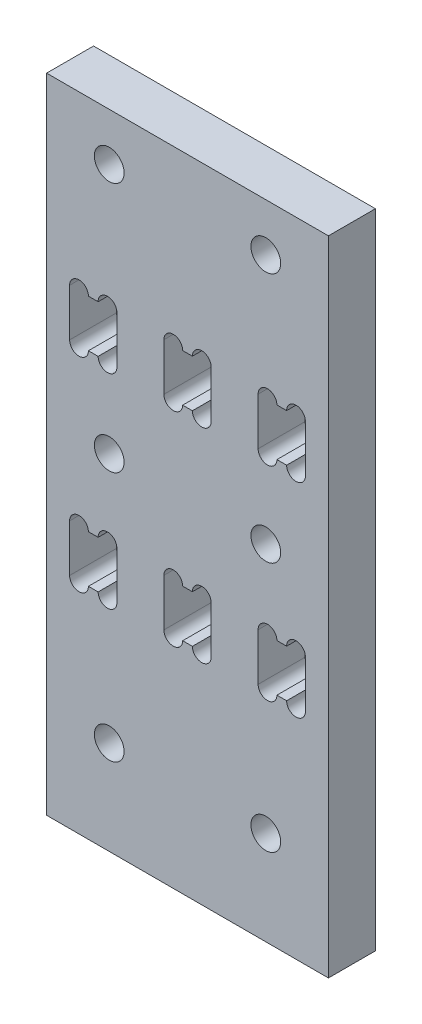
ISO-10303-21;
HEADER;
FILE_DESCRIPTION(('STEP AP214'),'2;1');
FILE_NAME('part.step','',(''),(''),'','','');
FILE_SCHEMA(('AUTOMOTIVE_DESIGN { 1 0 10303 214 1 1 1 1 }'));
ENDSEC;
DATA;
#1=APPLICATION_CONTEXT('core data for automotive mechanical design processes');
#2=APPLICATION_PROTOCOL_DEFINITION('international standard','automotive_design',2000,#1);
#3=PRODUCT_CONTEXT('',#1,'mechanical');
#4=PRODUCT('Part','Part','',(#3));
#5=PRODUCT_RELATED_PRODUCT_CATEGORY('part','',(#4));
#6=PRODUCT_DEFINITION_FORMATION('','',#4);
#7=PRODUCT_DEFINITION_CONTEXT('part definition',#1,'design');
#8=PRODUCT_DEFINITION('design','',#6,#7);
#9=PRODUCT_DEFINITION_SHAPE('','',#8);
#10=(LENGTH_UNIT() NAMED_UNIT(*) SI_UNIT(.MILLI.,.METRE.));
#11=(NAMED_UNIT(*) PLANE_ANGLE_UNIT() SI_UNIT($,.RADIAN.));
#12=(NAMED_UNIT(*) SI_UNIT($,.STERADIAN.) SOLID_ANGLE_UNIT());
#13=UNCERTAINTY_MEASURE_WITH_UNIT(LENGTH_MEASURE(1.E-05),#10,'distance_accuracy_value','');
#14=(GEOMETRIC_REPRESENTATION_CONTEXT(3) GLOBAL_UNCERTAINTY_ASSIGNED_CONTEXT((#13)) GLOBAL_UNIT_ASSIGNED_CONTEXT((#10,
#11,#12)) REPRESENTATION_CONTEXT('',''));
#15=CARTESIAN_POINT('',(0.,0.,0.));
#16=DIRECTION('',(0.,0.,1.));
#17=DIRECTION('',(1.,0.,0.));
#18=AXIS2_PLACEMENT_3D('',#15,#16,#17);
#19=CARTESIAN_POINT('',(0.,0.,15.));
#20=DIRECTION('',(0.,0.,1.));
#21=DIRECTION('',(1.,0.,0.));
#22=AXIS2_PLACEMENT_3D('',#19,#20,#21);
#23=PLANE('',#22);
#24=CARTESIAN_POINT('',(20.,190.,15.));
#25=DIRECTION('',(0.,0.,1.));
#26=DIRECTION('',(1.,0.,0.));
#27=AXIS2_PLACEMENT_3D('',#24,#25,#26);
#28=CIRCLE('',#27,4.75000000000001);
#29=CARTESIAN_POINT('',(24.75,190.,15.));
#30=VERTEX_POINT('',#29);
#31=EDGE_CURVE('E1354',#30,#30,#28,.T.);
#32=ORIENTED_EDGE('',*,*,#31,.F.);
#33=EDGE_LOOP('',(#32));
#34=FACE_BOUND('',#33,.T.);
#35=CARTESIAN_POINT('',(20.,110.,15.));
#36=DIRECTION('',(0.,0.,1.));
#37=DIRECTION('',(1.,0.,0.));
#38=AXIS2_PLACEMENT_3D('',#35,#36,#37);
#39=CIRCLE('',#38,4.75000000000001);
#40=CARTESIAN_POINT('',(24.75,110.,15.));
#41=VERTEX_POINT('',#40);
#42=EDGE_CURVE('E1366',#41,#41,#39,.T.);
#43=ORIENTED_EDGE('',*,*,#42,.F.);
#44=EDGE_LOOP('',(#43));
#45=FACE_BOUND('',#44,.T.);
#46=CARTESIAN_POINT('',(20.,30.,15.));
#47=DIRECTION('',(0.,0.,1.));
#48=DIRECTION('',(1.,0.,0.));
#49=AXIS2_PLACEMENT_3D('',#46,#47,#48);
#50=CIRCLE('',#49,4.75000000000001);
#51=CARTESIAN_POINT('',(24.75,30.,15.));
#52=VERTEX_POINT('',#51);
#53=EDGE_CURVE('E404',#52,#52,#50,.T.);
#54=ORIENTED_EDGE('',*,*,#53,.F.);
#55=EDGE_LOOP('',(#54));
#56=FACE_BOUND('',#55,.T.);
#57=DIRECTION('',(0.,-1.,0.));
#58=VECTOR('',#57,1.);
#59=CARTESIAN_POINT('',(37.45,150.25,15.));
#60=LINE('',#59,#58);
#61=CARTESIAN_POINT('',(37.45,150.25,15.));
#62=VERTEX_POINT('',#61);
#63=CARTESIAN_POINT('',(37.45,135.15,15.));
#64=VERTEX_POINT('',#63);
#65=EDGE_CURVE('E436',#62,#64,#60,.T.);
#66=ORIENTED_EDGE('',*,*,#65,.F.);
#67=CARTESIAN_POINT('',(40.45,150.25,15.));
#68=DIRECTION('',(0.,0.,1.));
#69=DIRECTION('',(-1.,0.,0.));
#70=AXIS2_PLACEMENT_3D('',#67,#68,#69);
#71=CIRCLE('',#70,3.);
#72=CARTESIAN_POINT('',(43.45,150.25,15.));
#73=VERTEX_POINT('',#72);
#74=EDGE_CURVE('E434',#73,#62,#71,.T.);
#75=ORIENTED_EDGE('',*,*,#74,.F.);
#76=DIRECTION('',(-1.,0.,0.));
#77=VECTOR('',#76,1.);
#78=CARTESIAN_POINT('',(43.45,150.25,15.));
#79=LINE('',#78,#77);
#80=CARTESIAN_POINT('',(46.55,150.25,15.));
#81=VERTEX_POINT('',#80);
#82=EDGE_CURVE('E450',#81,#73,#79,.T.);
#83=ORIENTED_EDGE('',*,*,#82,.F.);
#84=CARTESIAN_POINT('',(49.55,150.25,15.));
#85=DIRECTION('',(0.,0.,1.));
#86=DIRECTION('',(-1.,0.,0.));
#87=AXIS2_PLACEMENT_3D('',#84,#85,#86);
#88=CIRCLE('',#87,2.99999999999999);
#89=CARTESIAN_POINT('',(52.55,150.25,15.));
#90=VERTEX_POINT('',#89);
#91=EDGE_CURVE('E447',#90,#81,#88,.T.);
#92=ORIENTED_EDGE('',*,*,#91,.F.);
#93=DIRECTION('',(0.,1.,0.));
#94=VECTOR('',#93,1.);
#95=CARTESIAN_POINT('',(52.55,150.25,15.));
#96=LINE('',#95,#94);
#97=CARTESIAN_POINT('',(52.55,135.15,15.));
#98=VERTEX_POINT('',#97);
#99=EDGE_CURVE('E445',#98,#90,#96,.T.);
#100=ORIENTED_EDGE('',*,*,#99,.F.);
#101=CARTESIAN_POINT('',(49.55,135.15,15.));
#102=DIRECTION('',(0.,0.,1.));
#103=DIRECTION('',(1.,0.,0.));
#104=AXIS2_PLACEMENT_3D('',#101,#102,#103);
#105=CIRCLE('',#104,3.);
#106=CARTESIAN_POINT('',(46.55,135.15,15.));
#107=VERTEX_POINT('',#106);
#108=EDGE_CURVE('E443',#107,#98,#105,.T.);
#109=ORIENTED_EDGE('',*,*,#108,.F.);
#110=DIRECTION('',(1.,0.,0.));
#111=VECTOR('',#110,1.);
#112=CARTESIAN_POINT('',(43.45,135.15,15.));
#113=LINE('',#112,#111);
#114=CARTESIAN_POINT('',(43.45,135.15,15.));
#115=VERTEX_POINT('',#114);
#116=EDGE_CURVE('E441',#115,#107,#113,.T.);
#117=ORIENTED_EDGE('',*,*,#116,.F.);
#118=CARTESIAN_POINT('',(40.45,135.15,15.));
#119=DIRECTION('',(0.,0.,1.));
#120=DIRECTION('',(1.,0.,0.));
#121=AXIS2_PLACEMENT_3D('',#118,#119,#120);
#122=CIRCLE('',#121,3.00000000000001);
#123=EDGE_CURVE('E439',#64,#115,#122,.T.);
#124=ORIENTED_EDGE('',*,*,#123,.F.);
#125=EDGE_LOOP('',(#66,#75,#83,#92,#100,#109,#117,#124));
#126=FACE_BOUND('',#125,.T.);
#127=DIRECTION('',(0.,-1.,0.));
#128=VECTOR('',#127,1.);
#129=CARTESIAN_POINT('',(67.55,85.1,15.));
#130=LINE('',#129,#128);
#131=CARTESIAN_POINT('',(67.55,85.1,15.));
#132=VERTEX_POINT('',#131);
#133=CARTESIAN_POINT('',(67.55,70.,15.));
#134=VERTEX_POINT('',#133);
#135=EDGE_CURVE('E554',#132,#134,#130,.T.);
#136=ORIENTED_EDGE('',*,*,#135,.F.);
#137=CARTESIAN_POINT('',(70.55,85.1,15.));
#138=DIRECTION('',(0.,0.,1.));
#139=DIRECTION('',(-1.,0.,0.));
#140=AXIS2_PLACEMENT_3D('',#137,#138,#139);
#141=CIRCLE('',#140,3.);
#142=CARTESIAN_POINT('',(73.55,85.1,15.));
#143=VERTEX_POINT('',#142);
#144=EDGE_CURVE('E552',#143,#132,#141,.T.);
#145=ORIENTED_EDGE('',*,*,#144,.F.);
#146=DIRECTION('',(-1.,0.,0.));
#147=VECTOR('',#146,1.);
#148=CARTESIAN_POINT('',(73.55,85.1,15.));
#149=LINE('',#148,#147);
#150=CARTESIAN_POINT('',(76.65,85.1,15.));
#151=VERTEX_POINT('',#150);
#152=EDGE_CURVE('E568',#151,#143,#149,.T.);
#153=ORIENTED_EDGE('',*,*,#152,.F.);
#154=CARTESIAN_POINT('',(79.65,85.1,15.));
#155=DIRECTION('',(0.,0.,1.));
#156=DIRECTION('',(-1.,0.,0.));
#157=AXIS2_PLACEMENT_3D('',#154,#155,#156);
#158=CIRCLE('',#157,3.);
#159=CARTESIAN_POINT('',(82.65,85.1,15.));
#160=VERTEX_POINT('',#159);
#161=EDGE_CURVE('E565',#160,#151,#158,.T.);
#162=ORIENTED_EDGE('',*,*,#161,.F.);
#163=DIRECTION('',(0.,1.,0.));
#164=VECTOR('',#163,1.);
#165=CARTESIAN_POINT('',(82.65,85.1,15.));
#166=LINE('',#165,#164);
#167=CARTESIAN_POINT('',(82.65,70.,15.));
#168=VERTEX_POINT('',#167);
#169=EDGE_CURVE('E563',#168,#160,#166,.T.);
#170=ORIENTED_EDGE('',*,*,#169,.F.);
#171=CARTESIAN_POINT('',(79.65,70.,15.));
#172=DIRECTION('',(0.,0.,1.));
#173=DIRECTION('',(1.,0.,0.));
#174=AXIS2_PLACEMENT_3D('',#171,#172,#173);
#175=CIRCLE('',#174,3.);
#176=CARTESIAN_POINT('',(76.65,70.0000000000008,15.));
#177=VERTEX_POINT('',#176);
#178=EDGE_CURVE('E561',#177,#168,#175,.T.);
#179=ORIENTED_EDGE('',*,*,#178,.F.);
#180=DIRECTION('',(1.,0.,0.));
#181=VECTOR('',#180,1.);
#182=CARTESIAN_POINT('',(76.65,70.0000000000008,15.));
#183=LINE('',#182,#181);
#184=CARTESIAN_POINT('',(73.55,70.0000000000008,15.));
#185=VERTEX_POINT('',#184);
#186=EDGE_CURVE('E559',#185,#177,#183,.T.);
#187=ORIENTED_EDGE('',*,*,#186,.F.);
#188=CARTESIAN_POINT('',(70.55,70.,15.));
#189=DIRECTION('',(0.,0.,1.));
#190=DIRECTION('',(1.,0.,0.));
#191=AXIS2_PLACEMENT_3D('',#188,#189,#190);
#192=CIRCLE('',#191,3.00000000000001);
#193=EDGE_CURVE('E557',#134,#185,#192,.T.);
#194=ORIENTED_EDGE('',*,*,#193,.F.);
#195=EDGE_LOOP('',(#136,#145,#153,#162,#170,#179,#187,#194));
#196=FACE_BOUND('',#195,.T.);
#197=DIRECTION('',(0.,-1.,0.));
#198=VECTOR('',#197,1.);
#199=CARTESIAN_POINT('',(7.35000000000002,85.1,15.));
#200=LINE('',#199,#198);
#201=CARTESIAN_POINT('',(7.35000000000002,85.1,15.));
#202=VERTEX_POINT('',#201);
#203=CARTESIAN_POINT('',(7.35000000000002,70.,15.));
#204=VERTEX_POINT('',#203);
#205=EDGE_CURVE('E672',#202,#204,#200,.T.);
#206=ORIENTED_EDGE('',*,*,#205,.F.);
#207=CARTESIAN_POINT('',(10.35,85.1,15.));
#208=DIRECTION('',(0.,0.,1.));
#209=DIRECTION('',(-1.,0.,0.));
#210=AXIS2_PLACEMENT_3D('',#207,#208,#209);
#211=CIRCLE('',#210,3.);
#212=CARTESIAN_POINT('',(13.35,85.1,15.));
#213=VERTEX_POINT('',#212);
#214=EDGE_CURVE('E670',#213,#202,#211,.T.);
#215=ORIENTED_EDGE('',*,*,#214,.F.);
#216=DIRECTION('',(-1.,0.,0.));
#217=VECTOR('',#216,1.);
#218=CARTESIAN_POINT('',(13.35,85.1,15.));
#219=LINE('',#218,#217);
#220=CARTESIAN_POINT('',(16.45,85.1,15.));
#221=VERTEX_POINT('',#220);
#222=EDGE_CURVE('E686',#221,#213,#219,.T.);
#223=ORIENTED_EDGE('',*,*,#222,.F.);
#224=CARTESIAN_POINT('',(19.45,85.1,15.));
#225=DIRECTION('',(0.,0.,1.));
#226=DIRECTION('',(-1.,0.,0.));
#227=AXIS2_PLACEMENT_3D('',#224,#225,#226);
#228=CIRCLE('',#227,3.);
#229=CARTESIAN_POINT('',(22.45,85.1,15.));
#230=VERTEX_POINT('',#229);
#231=EDGE_CURVE('E683',#230,#221,#228,.T.);
#232=ORIENTED_EDGE('',*,*,#231,.F.);
#233=DIRECTION('',(0.,1.,0.));
#234=VECTOR('',#233,1.);
#235=CARTESIAN_POINT('',(22.45,85.1,15.));
#236=LINE('',#235,#234);
#237=CARTESIAN_POINT('',(22.45,70.,15.));
#238=VERTEX_POINT('',#237);
#239=EDGE_CURVE('E681',#238,#230,#236,.T.);
#240=ORIENTED_EDGE('',*,*,#239,.F.);
#241=CARTESIAN_POINT('',(19.45,70.,15.));
#242=DIRECTION('',(0.,0.,1.));
#243=DIRECTION('',(1.,0.,0.));
#244=AXIS2_PLACEMENT_3D('',#241,#242,#243);
#245=CIRCLE('',#244,3.);
#246=CARTESIAN_POINT('',(16.45,70.,15.));
#247=VERTEX_POINT('',#246);
#248=EDGE_CURVE('E679',#247,#238,#245,.T.);
#249=ORIENTED_EDGE('',*,*,#248,.F.);
#250=DIRECTION('',(1.,0.,0.));
#251=VECTOR('',#250,1.);
#252=CARTESIAN_POINT('',(13.35,70.,15.));
#253=LINE('',#252,#251);
#254=CARTESIAN_POINT('',(13.35,70.,15.));
#255=VERTEX_POINT('',#254);
#256=EDGE_CURVE('E677',#255,#247,#253,.T.);
#257=ORIENTED_EDGE('',*,*,#256,.F.);
#258=CARTESIAN_POINT('',(10.35,70.,15.));
#259=DIRECTION('',(0.,0.,1.));
#260=DIRECTION('',(1.,0.,0.));
#261=AXIS2_PLACEMENT_3D('',#258,#259,#260);
#262=CIRCLE('',#261,3.);
#263=EDGE_CURVE('E675',#204,#255,#262,.T.);
#264=ORIENTED_EDGE('',*,*,#263,.F.);
#265=EDGE_LOOP('',(#206,#215,#223,#232,#240,#249,#257,#264));
#266=FACE_BOUND('',#265,.T.);
#267=DIRECTION('',(0.,-1.,0.));
#268=VECTOR('',#267,1.);
#269=CARTESIAN_POINT('',(0.,205.25,15.));
#270=LINE('',#269,#268);
#271=CARTESIAN_POINT('',(0.,205.25,15.));
#272=VERTEX_POINT('',#271);
#273=CARTESIAN_POINT('',(0.,0.,15.));
#274=VERTEX_POINT('',#273);
#275=EDGE_CURVE('E729',#272,#274,#270,.T.);
#276=ORIENTED_EDGE('',*,*,#275,.T.);
#277=DIRECTION('',(1.,0.,0.));
#278=VECTOR('',#277,1.);
#279=CARTESIAN_POINT('',(0.,0.,15.));
#280=LINE('',#279,#278);
#281=CARTESIAN_POINT('',(90.,0.,15.));
#282=VERTEX_POINT('',#281);
#283=EDGE_CURVE('E732',#274,#282,#280,.T.);
#284=ORIENTED_EDGE('',*,*,#283,.T.);
#285=DIRECTION('',(0.,1.,0.));
#286=VECTOR('',#285,1.);
#287=CARTESIAN_POINT('',(90.,0.,15.));
#288=LINE('',#287,#286);
#289=CARTESIAN_POINT('',(90.,205.25,15.));
#290=VERTEX_POINT('',#289);
#291=EDGE_CURVE('E735',#282,#290,#288,.T.);
#292=ORIENTED_EDGE('',*,*,#291,.T.);
#293=DIRECTION('',(-1.,0.,0.));
#294=VECTOR('',#293,1.);
#295=CARTESIAN_POINT('',(90.,205.25,15.));
#296=LINE('',#295,#294);
#297=EDGE_CURVE('E738',#290,#272,#296,.T.);
#298=ORIENTED_EDGE('',*,*,#297,.T.);
#299=EDGE_LOOP('',(#276,#284,#292,#298));
#300=FACE_BOUND('',#299,.T.);
#301=DIRECTION('',(0.,-1.,0.));
#302=VECTOR('',#301,1.);
#303=CARTESIAN_POINT('',(37.45,85.1,15.));
#304=LINE('',#303,#302);
#305=CARTESIAN_POINT('',(37.45,85.1,15.));
#306=VERTEX_POINT('',#305);
#307=CARTESIAN_POINT('',(37.45,70.,15.));
#308=VERTEX_POINT('',#307);
#309=EDGE_CURVE('E613',#306,#308,#304,.T.);
#310=ORIENTED_EDGE('',*,*,#309,.F.);
#311=CARTESIAN_POINT('',(40.45,85.1,15.));
#312=DIRECTION('',(0.,0.,1.));
#313=DIRECTION('',(-1.,0.,0.));
#314=AXIS2_PLACEMENT_3D('',#311,#312,#313);
#315=CIRCLE('',#314,3.00000000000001);
#316=CARTESIAN_POINT('',(43.45,85.1,15.));
#317=VERTEX_POINT('',#316);
#318=EDGE_CURVE('E611',#317,#306,#315,.T.);
#319=ORIENTED_EDGE('',*,*,#318,.F.);
#320=DIRECTION('',(-1.,0.,0.));
#321=VECTOR('',#320,1.);
#322=CARTESIAN_POINT('',(43.45,85.1,15.));
#323=LINE('',#322,#321);
#324=CARTESIAN_POINT('',(46.55,85.1,15.));
#325=VERTEX_POINT('',#324);
#326=EDGE_CURVE('E627',#325,#317,#323,.T.);
#327=ORIENTED_EDGE('',*,*,#326,.F.);
#328=CARTESIAN_POINT('',(49.55,85.1,15.));
#329=DIRECTION('',(0.,0.,1.));
#330=DIRECTION('',(-1.,0.,0.));
#331=AXIS2_PLACEMENT_3D('',#328,#329,#330);
#332=CIRCLE('',#331,3.00000000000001);
#333=CARTESIAN_POINT('',(52.55,85.1,15.));
#334=VERTEX_POINT('',#333);
#335=EDGE_CURVE('E624',#334,#325,#332,.T.);
#336=ORIENTED_EDGE('',*,*,#335,.F.);
#337=DIRECTION('',(0.,1.,0.));
#338=VECTOR('',#337,1.);
#339=CARTESIAN_POINT('',(52.55,85.1,15.));
#340=LINE('',#339,#338);
#341=CARTESIAN_POINT('',(52.55,70.,15.));
#342=VERTEX_POINT('',#341);
#343=EDGE_CURVE('E622',#342,#334,#340,.T.);
#344=ORIENTED_EDGE('',*,*,#343,.F.);
#345=CARTESIAN_POINT('',(49.55,70.,15.));
#346=DIRECTION('',(0.,0.,1.));
#347=DIRECTION('',(1.,0.,0.));
#348=AXIS2_PLACEMENT_3D('',#345,#346,#347);
#349=CIRCLE('',#348,3.);
#350=CARTESIAN_POINT('',(46.55,70.,15.));
#351=VERTEX_POINT('',#350);
#352=EDGE_CURVE('E620',#351,#342,#349,.T.);
#353=ORIENTED_EDGE('',*,*,#352,.F.);
#354=DIRECTION('',(1.,0.,0.));
#355=VECTOR('',#354,1.);
#356=CARTESIAN_POINT('',(43.45,70.,15.));
#357=LINE('',#356,#355);
#358=CARTESIAN_POINT('',(43.45,70.,15.));
#359=VERTEX_POINT('',#358);
#360=EDGE_CURVE('E618',#359,#351,#357,.T.);
#361=ORIENTED_EDGE('',*,*,#360,.F.);
#362=CARTESIAN_POINT('',(40.45,70.,15.));
#363=DIRECTION('',(0.,0.,1.));
#364=DIRECTION('',(1.,0.,0.));
#365=AXIS2_PLACEMENT_3D('',#362,#363,#364);
#366=CIRCLE('',#365,3.);
#367=EDGE_CURVE('E616',#308,#359,#366,.T.);
#368=ORIENTED_EDGE('',*,*,#367,.F.);
#369=EDGE_LOOP('',(#310,#319,#327,#336,#344,#353,#361,#368));
#370=FACE_BOUND('',#369,.T.);
#371=DIRECTION('',(0.,-1.,0.));
#372=VECTOR('',#371,1.);
#373=CARTESIAN_POINT('',(7.35000000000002,150.25,15.));
#374=LINE('',#373,#372);
#375=CARTESIAN_POINT('',(7.35000000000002,150.25,15.));
#376=VERTEX_POINT('',#375);
#377=CARTESIAN_POINT('',(7.35000000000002,135.15,15.));
#378=VERTEX_POINT('',#377);
#379=EDGE_CURVE('E495',#376,#378,#374,.T.);
#380=ORIENTED_EDGE('',*,*,#379,.F.);
#381=CARTESIAN_POINT('',(10.35,150.25,15.));
#382=DIRECTION('',(0.,0.,1.));
#383=DIRECTION('',(-1.,0.,0.));
#384=AXIS2_PLACEMENT_3D('',#381,#382,#383);
#385=CIRCLE('',#384,3.);
#386=CARTESIAN_POINT('',(13.35,150.25,15.));
#387=VERTEX_POINT('',#386);
#388=EDGE_CURVE('E493',#387,#376,#385,.T.);
#389=ORIENTED_EDGE('',*,*,#388,.F.);
#390=DIRECTION('',(-1.,0.,0.));
#391=VECTOR('',#390,1.);
#392=CARTESIAN_POINT('',(13.35,150.25,15.));
#393=LINE('',#392,#391);
#394=CARTESIAN_POINT('',(16.45,150.25,15.));
#395=VERTEX_POINT('',#394);
#396=EDGE_CURVE('E509',#395,#387,#393,.T.);
#397=ORIENTED_EDGE('',*,*,#396,.F.);
#398=CARTESIAN_POINT('',(19.45,150.25,15.));
#399=DIRECTION('',(0.,0.,1.));
#400=DIRECTION('',(-1.,0.,0.));
#401=AXIS2_PLACEMENT_3D('',#398,#399,#400);
#402=CIRCLE('',#401,3.);
#403=CARTESIAN_POINT('',(22.45,150.25,15.));
#404=VERTEX_POINT('',#403);
#405=EDGE_CURVE('E506',#404,#395,#402,.T.);
#406=ORIENTED_EDGE('',*,*,#405,.F.);
#407=DIRECTION('',(0.,1.,0.));
#408=VECTOR('',#407,1.);
#409=CARTESIAN_POINT('',(22.45,150.25,15.));
#410=LINE('',#409,#408);
#411=CARTESIAN_POINT('',(22.45,135.15,15.));
#412=VERTEX_POINT('',#411);
#413=EDGE_CURVE('E504',#412,#404,#410,.T.);
#414=ORIENTED_EDGE('',*,*,#413,.F.);
#415=CARTESIAN_POINT('',(19.45,135.15,15.));
#416=DIRECTION('',(0.,0.,1.));
#417=DIRECTION('',(1.,0.,0.));
#418=AXIS2_PLACEMENT_3D('',#415,#416,#417);
#419=CIRCLE('',#418,3.);
#420=CARTESIAN_POINT('',(16.45,135.15,15.));
#421=VERTEX_POINT('',#420);
#422=EDGE_CURVE('E502',#421,#412,#419,.T.);
#423=ORIENTED_EDGE('',*,*,#422,.F.);
#424=DIRECTION('',(1.,0.,0.));
#425=VECTOR('',#424,1.);
#426=CARTESIAN_POINT('',(13.35,135.15,15.));
#427=LINE('',#426,#425);
#428=CARTESIAN_POINT('',(13.35,135.15,15.));
#429=VERTEX_POINT('',#428);
#430=EDGE_CURVE('E500',#429,#421,#427,.T.);
#431=ORIENTED_EDGE('',*,*,#430,.F.);
#432=CARTESIAN_POINT('',(10.35,135.15,15.));
#433=DIRECTION('',(0.,0.,1.));
#434=DIRECTION('',(1.,0.,0.));
#435=AXIS2_PLACEMENT_3D('',#432,#433,#434);
#436=CIRCLE('',#435,3.);
#437=EDGE_CURVE('E498',#378,#429,#436,.T.);
#438=ORIENTED_EDGE('',*,*,#437,.F.);
#439=EDGE_LOOP('',(#380,#389,#397,#406,#414,#423,#431,#438));
#440=FACE_BOUND('',#439,.T.);
#441=DIRECTION('',(0.,-1.,0.));
#442=VECTOR('',#441,1.);
#443=CARTESIAN_POINT('',(67.5499999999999,150.25,15.));
#444=LINE('',#443,#442);
#445=CARTESIAN_POINT('',(67.5499999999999,150.25,15.));
#446=VERTEX_POINT('',#445);
#447=CARTESIAN_POINT('',(67.5499999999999,135.15,15.));
#448=VERTEX_POINT('',#447);
#449=EDGE_CURVE('E374',#446,#448,#444,.T.);
#450=ORIENTED_EDGE('',*,*,#449,.F.);
#451=CARTESIAN_POINT('',(70.5499999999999,150.25,15.));
#452=DIRECTION('',(0.,0.,1.));
#453=DIRECTION('',(-1.,0.,0.));
#454=AXIS2_PLACEMENT_3D('',#451,#452,#453);
#455=CIRCLE('',#454,2.99999999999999);
#456=CARTESIAN_POINT('',(73.5499999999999,150.25,15.));
#457=VERTEX_POINT('',#456);
#458=EDGE_CURVE('E366',#457,#446,#455,.T.);
#459=ORIENTED_EDGE('',*,*,#458,.F.);
#460=DIRECTION('',(-1.,0.,0.));
#461=VECTOR('',#460,1.);
#462=CARTESIAN_POINT('',(73.5499999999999,150.25,15.));
#463=LINE('',#462,#461);
#464=CARTESIAN_POINT('',(76.65,150.25,15.));
#465=VERTEX_POINT('',#464);
#466=EDGE_CURVE('E401',#465,#457,#463,.T.);
#467=ORIENTED_EDGE('',*,*,#466,.F.);
#468=CARTESIAN_POINT('',(79.65,150.25,15.));
#469=DIRECTION('',(0.,0.,1.));
#470=DIRECTION('',(-1.,0.,0.));
#471=AXIS2_PLACEMENT_3D('',#468,#469,#470);
#472=CIRCLE('',#471,3.);
#473=CARTESIAN_POINT('',(82.65,150.25,15.));
#474=VERTEX_POINT('',#473);
#475=EDGE_CURVE('E399',#474,#465,#472,.T.);
#476=ORIENTED_EDGE('',*,*,#475,.F.);
#477=DIRECTION('',(0.,1.,0.));
#478=VECTOR('',#477,1.);
#479=CARTESIAN_POINT('',(82.65,150.25,15.));
#480=LINE('',#479,#478);
#481=CARTESIAN_POINT('',(82.65,135.15,15.));
#482=VERTEX_POINT('',#481);
#483=EDGE_CURVE('E397',#482,#474,#480,.T.);
#484=ORIENTED_EDGE('',*,*,#483,.F.);
#485=CARTESIAN_POINT('',(79.65,135.15,15.));
#486=DIRECTION('',(0.,0.,1.));
#487=DIRECTION('',(1.,0.,0.));
#488=AXIS2_PLACEMENT_3D('',#485,#486,#487);
#489=CIRCLE('',#488,3.);
#490=CARTESIAN_POINT('',(76.65,135.15,15.));
#491=VERTEX_POINT('',#490);
#492=EDGE_CURVE('E395',#491,#482,#489,.T.);
#493=ORIENTED_EDGE('',*,*,#492,.F.);
#494=DIRECTION('',(1.,0.,0.));
#495=VECTOR('',#494,1.);
#496=CARTESIAN_POINT('',(76.65,135.15,15.));
#497=LINE('',#496,#495);
#498=CARTESIAN_POINT('',(73.5499999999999,135.15,15.));
#499=VERTEX_POINT('',#498);
#500=EDGE_CURVE('E390',#499,#491,#497,.T.);
#501=ORIENTED_EDGE('',*,*,#500,.F.);
#502=CARTESIAN_POINT('',(70.5499999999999,135.15,15.));
#503=DIRECTION('',(0.,0.,1.));
#504=DIRECTION('',(1.,0.,0.));
#505=AXIS2_PLACEMENT_3D('',#502,#503,#504);
#506=CIRCLE('',#505,3.);
#507=EDGE_CURVE('E388',#448,#499,#506,.T.);
#508=ORIENTED_EDGE('',*,*,#507,.F.);
#509=EDGE_LOOP('',(#450,#459,#467,#476,#484,#493,#501,#508));
#510=FACE_BOUND('',#509,.T.);
#511=CARTESIAN_POINT('',(70.,30.,15.));
#512=DIRECTION('',(0.,0.,1.));
#513=DIRECTION('',(1.,0.,0.));
#514=AXIS2_PLACEMENT_3D('',#511,#512,#513);
#515=CIRCLE('',#514,4.75000000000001);
#516=CARTESIAN_POINT('',(74.75,30.,15.));
#517=VERTEX_POINT('',#516);
#518=EDGE_CURVE('E1372',#517,#517,#515,.T.);
#519=ORIENTED_EDGE('',*,*,#518,.F.);
#520=EDGE_LOOP('',(#519));
#521=FACE_BOUND('',#520,.T.);
#522=CARTESIAN_POINT('',(70.,110.,15.));
#523=DIRECTION('',(0.,0.,1.));
#524=DIRECTION('',(1.,0.,0.));
#525=AXIS2_PLACEMENT_3D('',#522,#523,#524);
#526=CIRCLE('',#525,4.75000000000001);
#527=CARTESIAN_POINT('',(74.75,110.,15.));
#528=VERTEX_POINT('',#527);
#529=EDGE_CURVE('E1360',#528,#528,#526,.T.);
#530=ORIENTED_EDGE('',*,*,#529,.F.);
#531=EDGE_LOOP('',(#530));
#532=FACE_BOUND('',#531,.T.);
#533=CARTESIAN_POINT('',(70.,190.,15.));
#534=DIRECTION('',(0.,0.,1.));
#535=DIRECTION('',(1.,0.,0.));
#536=AXIS2_PLACEMENT_3D('',#533,#534,#535);
#537=CIRCLE('',#536,4.75000000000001);
#538=CARTESIAN_POINT('',(74.75,190.,15.));
#539=VERTEX_POINT('',#538);
#540=EDGE_CURVE('E1345',#539,#539,#537,.T.);
#541=ORIENTED_EDGE('',*,*,#540,.F.);
#542=EDGE_LOOP('',(#541));
#543=FACE_BOUND('',#542,.T.);
#544=ADVANCED_FACE('F37',(#34,#45,#56,#126,#196,#266,#300,#370,#440,#510,#521,#532,#543),#23,.T.);
#545=CARTESIAN_POINT('',(0.,0.,0.));
#546=DIRECTION('',(0.,0.,1.));
#547=DIRECTION('',(1.,0.,0.));
#548=AXIS2_PLACEMENT_3D('',#545,#546,#547);
#549=PLANE('',#548);
#550=CARTESIAN_POINT('',(20.,190.,0.));
#551=DIRECTION('',(0.,0.,1.));
#552=DIRECTION('',(1.,0.,0.));
#553=AXIS2_PLACEMENT_3D('',#550,#551,#552);
#554=CIRCLE('',#553,4.75000000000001);
#555=CARTESIAN_POINT('',(24.75,190.,0.));
#556=VERTEX_POINT('',#555);
#557=EDGE_CURVE('E1351',#556,#556,#554,.T.);
#558=ORIENTED_EDGE('',*,*,#557,.T.);
#559=EDGE_LOOP('',(#558));
#560=FACE_BOUND('',#559,.T.);
#561=CARTESIAN_POINT('',(20.,110.,0.));
#562=DIRECTION('',(0.,0.,1.));
#563=DIRECTION('',(1.,0.,0.));
#564=AXIS2_PLACEMENT_3D('',#561,#562,#563);
#565=CIRCLE('',#564,4.75000000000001);
#566=CARTESIAN_POINT('',(24.75,110.,0.));
#567=VERTEX_POINT('',#566);
#568=EDGE_CURVE('E1363',#567,#567,#565,.T.);
#569=ORIENTED_EDGE('',*,*,#568,.T.);
#570=EDGE_LOOP('',(#569));
#571=FACE_BOUND('',#570,.T.);
#572=CARTESIAN_POINT('',(20.,30.,0.));
#573=DIRECTION('',(0.,0.,1.));
#574=DIRECTION('',(1.,0.,0.));
#575=AXIS2_PLACEMENT_3D('',#572,#573,#574);
#576=CIRCLE('',#575,4.75000000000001);
#577=CARTESIAN_POINT('',(24.75,30.,0.));
#578=VERTEX_POINT('',#577);
#579=EDGE_CURVE('E1375',#578,#578,#576,.T.);
#580=ORIENTED_EDGE('',*,*,#579,.T.);
#581=EDGE_LOOP('',(#580));
#582=FACE_BOUND('',#581,.T.);
#583=CARTESIAN_POINT('',(40.45,150.25,0.));
#584=DIRECTION('',(0.,0.,1.));
#585=DIRECTION('',(-1.,0.,0.));
#586=AXIS2_PLACEMENT_3D('',#583,#584,#585);
#587=CIRCLE('',#586,3.);
#588=CARTESIAN_POINT('',(43.45,150.25,0.));
#589=VERTEX_POINT('',#588);
#590=CARTESIAN_POINT('',(37.45,150.25,0.));
#591=VERTEX_POINT('',#590);
#592=EDGE_CURVE('E382',#589,#591,#587,.T.);
#593=ORIENTED_EDGE('',*,*,#592,.T.);
#594=DIRECTION('',(0.,-1.,0.));
#595=VECTOR('',#594,1.);
#596=CARTESIAN_POINT('',(37.45,150.25,0.));
#597=LINE('',#596,#595);
#598=CARTESIAN_POINT('',(37.45,135.15,0.));
#599=VERTEX_POINT('',#598);
#600=EDGE_CURVE('E455',#591,#599,#597,.T.);
#601=ORIENTED_EDGE('',*,*,#600,.T.);
#602=CARTESIAN_POINT('',(40.45,135.15,0.));
#603=DIRECTION('',(0.,0.,1.));
#604=DIRECTION('',(1.,0.,0.));
#605=AXIS2_PLACEMENT_3D('',#602,#603,#604);
#606=CIRCLE('',#605,3.00000000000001);
#607=CARTESIAN_POINT('',(43.45,135.15,0.));
#608=VERTEX_POINT('',#607);
#609=EDGE_CURVE('E458',#599,#608,#606,.T.);
#610=ORIENTED_EDGE('',*,*,#609,.T.);
#611=DIRECTION('',(1.,0.,0.));
#612=VECTOR('',#611,1.);
#613=CARTESIAN_POINT('',(43.45,135.15,0.));
#614=LINE('',#613,#612);
#615=CARTESIAN_POINT('',(46.55,135.15,0.));
#616=VERTEX_POINT('',#615);
#617=EDGE_CURVE('E461',#608,#616,#614,.T.);
#618=ORIENTED_EDGE('',*,*,#617,.T.);
#619=CARTESIAN_POINT('',(49.55,135.15,0.));
#620=DIRECTION('',(0.,0.,1.));
#621=DIRECTION('',(1.,0.,0.));
#622=AXIS2_PLACEMENT_3D('',#619,#620,#621);
#623=CIRCLE('',#622,3.);
#624=CARTESIAN_POINT('',(52.55,135.15,0.));
#625=VERTEX_POINT('',#624);
#626=EDGE_CURVE('E464',#616,#625,#623,.T.);
#627=ORIENTED_EDGE('',*,*,#626,.T.);
#628=DIRECTION('',(0.,1.,0.));
#629=VECTOR('',#628,1.);
#630=CARTESIAN_POINT('',(52.55,150.25,0.));
#631=LINE('',#630,#629);
#632=CARTESIAN_POINT('',(52.55,150.25,0.));
#633=VERTEX_POINT('',#632);
#634=EDGE_CURVE('E467',#625,#633,#631,.T.);
#635=ORIENTED_EDGE('',*,*,#634,.T.);
#636=CARTESIAN_POINT('',(49.55,150.25,0.));
#637=DIRECTION('',(0.,0.,1.));
#638=DIRECTION('',(-1.,0.,0.));
#639=AXIS2_PLACEMENT_3D('',#636,#637,#638);
#640=CIRCLE('',#639,2.99999999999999);
#641=CARTESIAN_POINT('',(46.55,150.25,0.));
#642=VERTEX_POINT('',#641);
#643=EDGE_CURVE('E470',#633,#642,#640,.T.);
#644=ORIENTED_EDGE('',*,*,#643,.T.);
#645=DIRECTION('',(-1.,0.,0.));
#646=VECTOR('',#645,1.);
#647=CARTESIAN_POINT('',(43.45,150.25,0.));
#648=LINE('',#647,#646);
#649=EDGE_CURVE('E437',#642,#589,#648,.T.);
#650=ORIENTED_EDGE('',*,*,#649,.T.);
#651=EDGE_LOOP('',(#593,#601,#610,#618,#627,#635,#644,#650));
#652=FACE_BOUND('',#651,.T.);
#653=CARTESIAN_POINT('',(70.55,85.1,0.));
#654=DIRECTION('',(0.,0.,1.));
#655=DIRECTION('',(-1.,0.,0.));
#656=AXIS2_PLACEMENT_3D('',#653,#654,#655);
#657=CIRCLE('',#656,3.);
#658=CARTESIAN_POINT('',(73.55,85.1,0.));
#659=VERTEX_POINT('',#658);
#660=CARTESIAN_POINT('',(67.55,85.1,0.));
#661=VERTEX_POINT('',#660);
#662=EDGE_CURVE('E551',#659,#661,#657,.T.);
#663=ORIENTED_EDGE('',*,*,#662,.T.);
#664=DIRECTION('',(0.,-1.,0.));
#665=VECTOR('',#664,1.);
#666=CARTESIAN_POINT('',(67.55,85.1,0.));
#667=LINE('',#666,#665);
#668=CARTESIAN_POINT('',(67.55,70.,0.));
#669=VERTEX_POINT('',#668);
#670=EDGE_CURVE('E573',#661,#669,#667,.T.);
#671=ORIENTED_EDGE('',*,*,#670,.T.);
#672=CARTESIAN_POINT('',(70.55,70.,0.));
#673=DIRECTION('',(0.,0.,1.));
#674=DIRECTION('',(1.,0.,0.));
#675=AXIS2_PLACEMENT_3D('',#672,#673,#674);
#676=CIRCLE('',#675,3.00000000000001);
#677=CARTESIAN_POINT('',(73.55,70.0000000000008,0.));
#678=VERTEX_POINT('',#677);
#679=EDGE_CURVE('E576',#669,#678,#676,.T.);
#680=ORIENTED_EDGE('',*,*,#679,.T.);
#681=DIRECTION('',(1.,0.,0.));
#682=VECTOR('',#681,1.);
#683=CARTESIAN_POINT('',(76.65,70.0000000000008,0.));
#684=LINE('',#683,#682);
#685=CARTESIAN_POINT('',(76.65,70.0000000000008,0.));
#686=VERTEX_POINT('',#685);
#687=EDGE_CURVE('E579',#678,#686,#684,.T.);
#688=ORIENTED_EDGE('',*,*,#687,.T.);
#689=CARTESIAN_POINT('',(79.65,70.,0.));
#690=DIRECTION('',(0.,0.,1.));
#691=DIRECTION('',(1.,0.,0.));
#692=AXIS2_PLACEMENT_3D('',#689,#690,#691);
#693=CIRCLE('',#692,3.);
#694=CARTESIAN_POINT('',(82.65,70.,0.));
#695=VERTEX_POINT('',#694);
#696=EDGE_CURVE('E582',#686,#695,#693,.T.);
#697=ORIENTED_EDGE('',*,*,#696,.T.);
#698=DIRECTION('',(0.,1.,0.));
#699=VECTOR('',#698,1.);
#700=CARTESIAN_POINT('',(82.65,85.1,0.));
#701=LINE('',#700,#699);
#702=CARTESIAN_POINT('',(82.65,85.1,0.));
#703=VERTEX_POINT('',#702);
#704=EDGE_CURVE('E585',#695,#703,#701,.T.);
#705=ORIENTED_EDGE('',*,*,#704,.T.);
#706=CARTESIAN_POINT('',(79.65,85.1,0.));
#707=DIRECTION('',(0.,0.,1.));
#708=DIRECTION('',(-1.,0.,0.));
#709=AXIS2_PLACEMENT_3D('',#706,#707,#708);
#710=CIRCLE('',#709,3.);
#711=CARTESIAN_POINT('',(76.65,85.1,0.));
#712=VERTEX_POINT('',#711);
#713=EDGE_CURVE('E588',#703,#712,#710,.T.);
#714=ORIENTED_EDGE('',*,*,#713,.T.);
#715=DIRECTION('',(-1.,0.,0.));
#716=VECTOR('',#715,1.);
#717=CARTESIAN_POINT('',(73.55,85.1,0.));
#718=LINE('',#717,#716);
#719=EDGE_CURVE('E555',#712,#659,#718,.T.);
#720=ORIENTED_EDGE('',*,*,#719,.T.);
#721=EDGE_LOOP('',(#663,#671,#680,#688,#697,#705,#714,#720));
#722=FACE_BOUND('',#721,.T.);
#723=CARTESIAN_POINT('',(10.35,85.1,0.));
#724=DIRECTION('',(0.,0.,1.));
#725=DIRECTION('',(-1.,0.,0.));
#726=AXIS2_PLACEMENT_3D('',#723,#724,#725);
#727=CIRCLE('',#726,3.);
#728=CARTESIAN_POINT('',(13.35,85.1,0.));
#729=VERTEX_POINT('',#728);
#730=CARTESIAN_POINT('',(7.35000000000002,85.1,0.));
#731=VERTEX_POINT('',#730);
#732=EDGE_CURVE('E669',#729,#731,#727,.T.);
#733=ORIENTED_EDGE('',*,*,#732,.T.);
#734=DIRECTION('',(0.,-1.,0.));
#735=VECTOR('',#734,1.);
#736=CARTESIAN_POINT('',(7.35000000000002,85.1,0.));
#737=LINE('',#736,#735);
#738=CARTESIAN_POINT('',(7.35000000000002,70.,0.));
#739=VERTEX_POINT('',#738);
#740=EDGE_CURVE('E691',#731,#739,#737,.T.);
#741=ORIENTED_EDGE('',*,*,#740,.T.);
#742=CARTESIAN_POINT('',(10.35,70.,0.));
#743=DIRECTION('',(0.,0.,1.));
#744=DIRECTION('',(1.,0.,0.));
#745=AXIS2_PLACEMENT_3D('',#742,#743,#744);
#746=CIRCLE('',#745,3.);
#747=CARTESIAN_POINT('',(13.35,70.,0.));
#748=VERTEX_POINT('',#747);
#749=EDGE_CURVE('E694',#739,#748,#746,.T.);
#750=ORIENTED_EDGE('',*,*,#749,.T.);
#751=DIRECTION('',(1.,0.,0.));
#752=VECTOR('',#751,1.);
#753=CARTESIAN_POINT('',(13.35,70.,0.));
#754=LINE('',#753,#752);
#755=CARTESIAN_POINT('',(16.45,70.,0.));
#756=VERTEX_POINT('',#755);
#757=EDGE_CURVE('E697',#748,#756,#754,.T.);
#758=ORIENTED_EDGE('',*,*,#757,.T.);
#759=CARTESIAN_POINT('',(19.45,70.,0.));
#760=DIRECTION('',(0.,0.,1.));
#761=DIRECTION('',(1.,0.,0.));
#762=AXIS2_PLACEMENT_3D('',#759,#760,#761);
#763=CIRCLE('',#762,3.);
#764=CARTESIAN_POINT('',(22.45,70.,0.));
#765=VERTEX_POINT('',#764);
#766=EDGE_CURVE('E700',#756,#765,#763,.T.);
#767=ORIENTED_EDGE('',*,*,#766,.T.);
#768=DIRECTION('',(0.,1.,0.));
#769=VECTOR('',#768,1.);
#770=CARTESIAN_POINT('',(22.45,85.1,0.));
#771=LINE('',#770,#769);
#772=CARTESIAN_POINT('',(22.45,85.1,0.));
#773=VERTEX_POINT('',#772);
#774=EDGE_CURVE('E703',#765,#773,#771,.T.);
#775=ORIENTED_EDGE('',*,*,#774,.T.);
#776=CARTESIAN_POINT('',(19.45,85.1,0.));
#777=DIRECTION('',(0.,0.,1.));
#778=DIRECTION('',(-1.,0.,0.));
#779=AXIS2_PLACEMENT_3D('',#776,#777,#778);
#780=CIRCLE('',#779,3.);
#781=CARTESIAN_POINT('',(16.45,85.1,0.));
#782=VERTEX_POINT('',#781);
#783=EDGE_CURVE('E706',#773,#782,#780,.T.);
#784=ORIENTED_EDGE('',*,*,#783,.T.);
#785=DIRECTION('',(-1.,0.,0.));
#786=VECTOR('',#785,1.);
#787=CARTESIAN_POINT('',(13.35,85.1,0.));
#788=LINE('',#787,#786);
#789=EDGE_CURVE('E673',#782,#729,#788,.T.);
#790=ORIENTED_EDGE('',*,*,#789,.T.);
#791=EDGE_LOOP('',(#733,#741,#750,#758,#767,#775,#784,#790));
#792=FACE_BOUND('',#791,.T.);
#793=DIRECTION('',(0.,-1.,0.));
#794=VECTOR('',#793,1.);
#795=CARTESIAN_POINT('',(0.,205.25,0.));
#796=LINE('',#795,#794);
#797=CARTESIAN_POINT('',(0.,205.25,0.));
#798=VERTEX_POINT('',#797);
#799=CARTESIAN_POINT('',(0.,0.,0.));
#800=VERTEX_POINT('',#799);
#801=EDGE_CURVE('E728',#798,#800,#796,.T.);
#802=ORIENTED_EDGE('',*,*,#801,.F.);
#803=DIRECTION('',(-1.,0.,0.));
#804=VECTOR('',#803,1.);
#805=CARTESIAN_POINT('',(90.,205.25,0.));
#806=LINE('',#805,#804);
#807=CARTESIAN_POINT('',(90.,205.25,0.));
#808=VERTEX_POINT('',#807);
#809=EDGE_CURVE('E733',#808,#798,#806,.T.);
#810=ORIENTED_EDGE('',*,*,#809,.F.);
#811=DIRECTION('',(0.,1.,0.));
#812=VECTOR('',#811,1.);
#813=CARTESIAN_POINT('',(90.,0.,0.));
#814=LINE('',#813,#812);
#815=CARTESIAN_POINT('',(90.,0.,0.));
#816=VERTEX_POINT('',#815);
#817=EDGE_CURVE('E745',#816,#808,#814,.T.);
#818=ORIENTED_EDGE('',*,*,#817,.F.);
#819=DIRECTION('',(1.,0.,0.));
#820=VECTOR('',#819,1.);
#821=CARTESIAN_POINT('',(0.,0.,0.));
#822=LINE('',#821,#820);
#823=EDGE_CURVE('E743',#800,#816,#822,.T.);
#824=ORIENTED_EDGE('',*,*,#823,.F.);
#825=EDGE_LOOP('',(#802,#810,#818,#824));
#826=FACE_BOUND('',#825,.T.);
#827=CARTESIAN_POINT('',(40.45,85.1,0.));
#828=DIRECTION('',(0.,0.,1.));
#829=DIRECTION('',(-1.,0.,0.));
#830=AXIS2_PLACEMENT_3D('',#827,#828,#829);
#831=CIRCLE('',#830,3.00000000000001);
#832=CARTESIAN_POINT('',(43.45,85.1,0.));
#833=VERTEX_POINT('',#832);
#834=CARTESIAN_POINT('',(37.45,85.1,0.));
#835=VERTEX_POINT('',#834);
#836=EDGE_CURVE('E610',#833,#835,#831,.T.);
#837=ORIENTED_EDGE('',*,*,#836,.T.);
#838=DIRECTION('',(0.,-1.,0.));
#839=VECTOR('',#838,1.);
#840=CARTESIAN_POINT('',(37.45,85.1,0.));
#841=LINE('',#840,#839);
#842=CARTESIAN_POINT('',(37.45,70.,0.));
#843=VERTEX_POINT('',#842);
#844=EDGE_CURVE('E632',#835,#843,#841,.T.);
#845=ORIENTED_EDGE('',*,*,#844,.T.);
#846=CARTESIAN_POINT('',(40.45,70.,0.));
#847=DIRECTION('',(0.,0.,1.));
#848=DIRECTION('',(1.,0.,0.));
#849=AXIS2_PLACEMENT_3D('',#846,#847,#848);
#850=CIRCLE('',#849,3.);
#851=CARTESIAN_POINT('',(43.45,70.,0.));
#852=VERTEX_POINT('',#851);
#853=EDGE_CURVE('E635',#843,#852,#850,.T.);
#854=ORIENTED_EDGE('',*,*,#853,.T.);
#855=DIRECTION('',(1.,0.,0.));
#856=VECTOR('',#855,1.);
#857=CARTESIAN_POINT('',(43.45,70.,0.));
#858=LINE('',#857,#856);
#859=CARTESIAN_POINT('',(46.55,70.,0.));
#860=VERTEX_POINT('',#859);
#861=EDGE_CURVE('E638',#852,#860,#858,.T.);
#862=ORIENTED_EDGE('',*,*,#861,.T.);
#863=CARTESIAN_POINT('',(49.55,70.,0.));
#864=DIRECTION('',(0.,0.,1.));
#865=DIRECTION('',(1.,0.,0.));
#866=AXIS2_PLACEMENT_3D('',#863,#864,#865);
#867=CIRCLE('',#866,3.);
#868=CARTESIAN_POINT('',(52.55,70.,0.));
#869=VERTEX_POINT('',#868);
#870=EDGE_CURVE('E641',#860,#869,#867,.T.);
#871=ORIENTED_EDGE('',*,*,#870,.T.);
#872=DIRECTION('',(0.,1.,0.));
#873=VECTOR('',#872,1.);
#874=CARTESIAN_POINT('',(52.55,85.1,0.));
#875=LINE('',#874,#873);
#876=CARTESIAN_POINT('',(52.55,85.1,0.));
#877=VERTEX_POINT('',#876);
#878=EDGE_CURVE('E644',#869,#877,#875,.T.);
#879=ORIENTED_EDGE('',*,*,#878,.T.);
#880=CARTESIAN_POINT('',(49.55,85.1,0.));
#881=DIRECTION('',(0.,0.,1.));
#882=DIRECTION('',(-1.,0.,0.));
#883=AXIS2_PLACEMENT_3D('',#880,#881,#882);
#884=CIRCLE('',#883,3.00000000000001);
#885=CARTESIAN_POINT('',(46.55,85.1,0.));
#886=VERTEX_POINT('',#885);
#887=EDGE_CURVE('E647',#877,#886,#884,.T.);
#888=ORIENTED_EDGE('',*,*,#887,.T.);
#889=DIRECTION('',(-1.,0.,0.));
#890=VECTOR('',#889,1.);
#891=CARTESIAN_POINT('',(43.45,85.1,0.));
#892=LINE('',#891,#890);
#893=EDGE_CURVE('E614',#886,#833,#892,.T.);
#894=ORIENTED_EDGE('',*,*,#893,.T.);
#895=EDGE_LOOP('',(#837,#845,#854,#862,#871,#879,#888,#894));
#896=FACE_BOUND('',#895,.T.);
#897=CARTESIAN_POINT('',(10.35,150.25,0.));
#898=DIRECTION('',(0.,0.,1.));
#899=DIRECTION('',(-1.,0.,0.));
#900=AXIS2_PLACEMENT_3D('',#897,#898,#899);
#901=CIRCLE('',#900,3.);
#902=CARTESIAN_POINT('',(13.35,150.25,0.));
#903=VERTEX_POINT('',#902);
#904=CARTESIAN_POINT('',(7.35000000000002,150.25,0.));
#905=VERTEX_POINT('',#904);
#906=EDGE_CURVE('E492',#903,#905,#901,.T.);
#907=ORIENTED_EDGE('',*,*,#906,.T.);
#908=DIRECTION('',(0.,-1.,0.));
#909=VECTOR('',#908,1.);
#910=CARTESIAN_POINT('',(7.35000000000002,150.25,0.));
#911=LINE('',#910,#909);
#912=CARTESIAN_POINT('',(7.35000000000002,135.15,0.));
#913=VERTEX_POINT('',#912);
#914=EDGE_CURVE('E514',#905,#913,#911,.T.);
#915=ORIENTED_EDGE('',*,*,#914,.T.);
#916=CARTESIAN_POINT('',(10.35,135.15,0.));
#917=DIRECTION('',(0.,0.,1.));
#918=DIRECTION('',(1.,0.,0.));
#919=AXIS2_PLACEMENT_3D('',#916,#917,#918);
#920=CIRCLE('',#919,3.);
#921=CARTESIAN_POINT('',(13.35,135.15,0.));
#922=VERTEX_POINT('',#921);
#923=EDGE_CURVE('E517',#913,#922,#920,.T.);
#924=ORIENTED_EDGE('',*,*,#923,.T.);
#925=DIRECTION('',(1.,0.,0.));
#926=VECTOR('',#925,1.);
#927=CARTESIAN_POINT('',(13.35,135.15,0.));
#928=LINE('',#927,#926);
#929=CARTESIAN_POINT('',(16.45,135.15,0.));
#930=VERTEX_POINT('',#929);
#931=EDGE_CURVE('E520',#922,#930,#928,.T.);
#932=ORIENTED_EDGE('',*,*,#931,.T.);
#933=CARTESIAN_POINT('',(19.45,135.15,0.));
#934=DIRECTION('',(0.,0.,1.));
#935=DIRECTION('',(1.,0.,0.));
#936=AXIS2_PLACEMENT_3D('',#933,#934,#935);
#937=CIRCLE('',#936,3.);
#938=CARTESIAN_POINT('',(22.45,135.15,0.));
#939=VERTEX_POINT('',#938);
#940=EDGE_CURVE('E523',#930,#939,#937,.T.);
#941=ORIENTED_EDGE('',*,*,#940,.T.);
#942=DIRECTION('',(0.,1.,0.));
#943=VECTOR('',#942,1.);
#944=CARTESIAN_POINT('',(22.45,150.25,0.));
#945=LINE('',#944,#943);
#946=CARTESIAN_POINT('',(22.45,150.25,0.));
#947=VERTEX_POINT('',#946);
#948=EDGE_CURVE('E526',#939,#947,#945,.T.);
#949=ORIENTED_EDGE('',*,*,#948,.T.);
#950=CARTESIAN_POINT('',(19.45,150.25,0.));
#951=DIRECTION('',(0.,0.,1.));
#952=DIRECTION('',(-1.,0.,0.));
#953=AXIS2_PLACEMENT_3D('',#950,#951,#952);
#954=CIRCLE('',#953,3.);
#955=CARTESIAN_POINT('',(16.45,150.25,0.));
#956=VERTEX_POINT('',#955);
#957=EDGE_CURVE('E529',#947,#956,#954,.T.);
#958=ORIENTED_EDGE('',*,*,#957,.T.);
#959=DIRECTION('',(-1.,0.,0.));
#960=VECTOR('',#959,1.);
#961=CARTESIAN_POINT('',(13.35,150.25,0.));
#962=LINE('',#961,#960);
#963=EDGE_CURVE('E496',#956,#903,#962,.T.);
#964=ORIENTED_EDGE('',*,*,#963,.T.);
#965=EDGE_LOOP('',(#907,#915,#924,#932,#941,#949,#958,#964));
#966=FACE_BOUND('',#965,.T.);
#967=CARTESIAN_POINT('',(70.5499999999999,150.25,0.));
#968=DIRECTION('',(0.,0.,1.));
#969=DIRECTION('',(-1.,0.,0.));
#970=AXIS2_PLACEMENT_3D('',#967,#968,#969);
#971=CIRCLE('',#970,2.99999999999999);
#972=CARTESIAN_POINT('',(73.5499999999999,150.25,0.));
#973=VERTEX_POINT('',#972);
#974=CARTESIAN_POINT('',(67.5499999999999,150.25,0.));
#975=VERTEX_POINT('',#974);
#976=EDGE_CURVE('E60',#973,#975,#971,.T.);
#977=ORIENTED_EDGE('',*,*,#976,.T.);
#978=DIRECTION('',(0.,-1.,0.));
#979=VECTOR('',#978,1.);
#980=CARTESIAN_POINT('',(67.5499999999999,150.25,0.));
#981=LINE('',#980,#979);
#982=CARTESIAN_POINT('',(67.5499999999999,135.15,0.));
#983=VERTEX_POINT('',#982);
#984=EDGE_CURVE('E381',#975,#983,#981,.T.);
#985=ORIENTED_EDGE('',*,*,#984,.T.);
#986=CARTESIAN_POINT('',(70.5499999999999,135.15,0.));
#987=DIRECTION('',(0.,0.,1.));
#988=DIRECTION('',(1.,0.,0.));
#989=AXIS2_PLACEMENT_3D('',#986,#987,#988);
#990=CIRCLE('',#989,3.);
#991=CARTESIAN_POINT('',(73.5499999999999,135.15,0.));
#992=VERTEX_POINT('',#991);
#993=EDGE_CURVE('E406',#983,#992,#990,.T.);
#994=ORIENTED_EDGE('',*,*,#993,.T.);
#995=DIRECTION('',(1.,0.,0.));
#996=VECTOR('',#995,1.);
#997=CARTESIAN_POINT('',(76.65,135.15,0.));
#998=LINE('',#997,#996);
#999=CARTESIAN_POINT('',(76.65,135.15,0.));
#1000=VERTEX_POINT('',#999);
#1001=EDGE_CURVE('E409',#992,#1000,#998,.T.);
#1002=ORIENTED_EDGE('',*,*,#1001,.T.);
#1003=CARTESIAN_POINT('',(79.65,135.15,0.));
#1004=DIRECTION('',(0.,0.,1.));
#1005=DIRECTION('',(1.,0.,0.));
#1006=AXIS2_PLACEMENT_3D('',#1003,#1004,#1005);
#1007=CIRCLE('',#1006,3.);
#1008=CARTESIAN_POINT('',(82.65,135.15,0.));
#1009=VERTEX_POINT('',#1008);
#1010=EDGE_CURVE('E412',#1000,#1009,#1007,.T.);
#1011=ORIENTED_EDGE('',*,*,#1010,.T.);
#1012=DIRECTION('',(0.,1.,0.));
#1013=VECTOR('',#1012,1.);
#1014=CARTESIAN_POINT('',(82.65,150.25,0.));
#1015=LINE('',#1014,#1013);
#1016=CARTESIAN_POINT('',(82.65,150.25,0.));
#1017=VERTEX_POINT('',#1016);
#1018=EDGE_CURVE('E415',#1009,#1017,#1015,.T.);
#1019=ORIENTED_EDGE('',*,*,#1018,.T.);
#1020=CARTESIAN_POINT('',(79.65,150.25,0.));
#1021=DIRECTION('',(0.,0.,1.));
#1022=DIRECTION('',(-1.,0.,0.));
#1023=AXIS2_PLACEMENT_3D('',#1020,#1021,#1022);
#1024=CIRCLE('',#1023,3.);
#1025=CARTESIAN_POINT('',(76.65,150.25,0.));
#1026=VERTEX_POINT('',#1025);
#1027=EDGE_CURVE('E418',#1017,#1026,#1024,.T.);
#1028=ORIENTED_EDGE('',*,*,#1027,.T.);
#1029=DIRECTION('',(-1.,0.,0.));
#1030=VECTOR('',#1029,1.);
#1031=CARTESIAN_POINT('',(73.5499999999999,150.25,0.));
#1032=LINE('',#1031,#1030);
#1033=EDGE_CURVE('E375',#1026,#973,#1032,.T.);
#1034=ORIENTED_EDGE('',*,*,#1033,.T.);
#1035=EDGE_LOOP('',(#977,#985,#994,#1002,#1011,#1019,#1028,#1034));
#1036=FACE_BOUND('',#1035,.T.);
#1037=CARTESIAN_POINT('',(70.,30.,0.));
#1038=DIRECTION('',(0.,0.,1.));
#1039=DIRECTION('',(1.,0.,0.));
#1040=AXIS2_PLACEMENT_3D('',#1037,#1038,#1039);
#1041=CIRCLE('',#1040,4.75000000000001);
#1042=CARTESIAN_POINT('',(74.75,30.,0.));
#1043=VERTEX_POINT('',#1042);
#1044=EDGE_CURVE('E1369',#1043,#1043,#1041,.T.);
#1045=ORIENTED_EDGE('',*,*,#1044,.T.);
#1046=EDGE_LOOP('',(#1045));
#1047=FACE_BOUND('',#1046,.T.);
#1048=CARTESIAN_POINT('',(70.,110.,0.));
#1049=DIRECTION('',(0.,0.,1.));
#1050=DIRECTION('',(1.,0.,0.));
#1051=AXIS2_PLACEMENT_3D('',#1048,#1049,#1050);
#1052=CIRCLE('',#1051,4.75000000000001);
#1053=CARTESIAN_POINT('',(74.75,110.,0.));
#1054=VERTEX_POINT('',#1053);
#1055=EDGE_CURVE('E1357',#1054,#1054,#1052,.T.);
#1056=ORIENTED_EDGE('',*,*,#1055,.T.);
#1057=EDGE_LOOP('',(#1056));
#1058=FACE_BOUND('',#1057,.T.);
#1059=CARTESIAN_POINT('',(70.,190.,0.));
#1060=DIRECTION('',(0.,0.,1.));
#1061=DIRECTION('',(1.,0.,0.));
#1062=AXIS2_PLACEMENT_3D('',#1059,#1060,#1061);
#1063=CIRCLE('',#1062,4.75000000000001);
#1064=CARTESIAN_POINT('',(74.75,190.,0.));
#1065=VERTEX_POINT('',#1064);
#1066=EDGE_CURVE('E1348',#1065,#1065,#1063,.T.);
#1067=ORIENTED_EDGE('',*,*,#1066,.T.);
#1068=EDGE_LOOP('',(#1067));
#1069=FACE_BOUND('',#1068,.T.);
#1070=ADVANCED_FACE('F764',(#560,#571,#582,#652,#722,#792,#826,#896,#966,#1036,#1047,#1058,
#1069),#549,.F.);
#1071=CARTESIAN_POINT('',(0.,205.25,15.));
#1072=DIRECTION('',(1.,0.,0.));
#1073=DIRECTION('',(0.,0.,-1.));
#1074=AXIS2_PLACEMENT_3D('',#1071,#1072,#1073);
#1075=PLANE('',#1074);
#1076=ORIENTED_EDGE('',*,*,#801,.T.);
#1077=DIRECTION('',(0.,0.,-1.));
#1078=VECTOR('',#1077,1.);
#1079=CARTESIAN_POINT('',(0.,0.,15.));
#1080=LINE('',#1079,#1078);
#1081=EDGE_CURVE('E11',#274,#800,#1080,.T.);
#1082=ORIENTED_EDGE('',*,*,#1081,.F.);
#1083=ORIENTED_EDGE('',*,*,#275,.F.);
#1084=DIRECTION('',(0.,0.,-1.));
#1085=VECTOR('',#1084,1.);
#1086=CARTESIAN_POINT('',(0.,205.25,15.));
#1087=LINE('',#1086,#1085);
#1088=EDGE_CURVE('E740',#272,#798,#1087,.T.);
#1089=ORIENTED_EDGE('',*,*,#1088,.T.);
#1090=EDGE_LOOP('',(#1076,#1082,#1083,#1089));
#1091=FACE_BOUND('',#1090,.T.);
#1092=ADVANCED_FACE('F39',(#1091),#1075,.F.);
#1093=CARTESIAN_POINT('',(0.,0.,15.));
#1094=DIRECTION('',(0.,1.,0.));
#1095=DIRECTION('',(0.,0.,1.));
#1096=AXIS2_PLACEMENT_3D('',#1093,#1094,#1095);
#1097=PLANE('',#1096);
#1098=ORIENTED_EDGE('',*,*,#823,.T.);
#1099=DIRECTION('',(0.,0.,-1.));
#1100=VECTOR('',#1099,1.);
#1101=CARTESIAN_POINT('',(90.,0.,15.));
#1102=LINE('',#1101,#1100);
#1103=EDGE_CURVE('E45',#282,#816,#1102,.T.);
#1104=ORIENTED_EDGE('',*,*,#1103,.F.);
#1105=ORIENTED_EDGE('',*,*,#283,.F.);
#1106=ORIENTED_EDGE('',*,*,#1081,.T.);
#1107=EDGE_LOOP('',(#1098,#1104,#1105,#1106));
#1108=FACE_BOUND('',#1107,.T.);
#1109=ADVANCED_FACE('F775',(#1108),#1097,.F.);
#1110=CARTESIAN_POINT('',(90.,0.,15.));
#1111=DIRECTION('',(-1.,0.,0.));
#1112=DIRECTION('',(0.,0.,1.));
#1113=AXIS2_PLACEMENT_3D('',#1110,#1111,#1112);
#1114=PLANE('',#1113);
#1115=ORIENTED_EDGE('',*,*,#817,.T.);
#1116=DIRECTION('',(0.,0.,-1.));
#1117=VECTOR('',#1116,1.);
#1118=CARTESIAN_POINT('',(90.,205.25,15.));
#1119=LINE('',#1118,#1117);
#1120=EDGE_CURVE('E751',#290,#808,#1119,.T.);
#1121=ORIENTED_EDGE('',*,*,#1120,.F.);
#1122=ORIENTED_EDGE('',*,*,#291,.F.);
#1123=ORIENTED_EDGE('',*,*,#1103,.T.);
#1124=EDGE_LOOP('',(#1115,#1121,#1122,#1123));
#1125=FACE_BOUND('',#1124,.T.);
#1126=ADVANCED_FACE('F758',(#1125),#1114,.F.);
#1127=CARTESIAN_POINT('',(90.,205.25,15.));
#1128=DIRECTION('',(0.,-1.,0.));
#1129=DIRECTION('',(0.,0.,-1.));
#1130=AXIS2_PLACEMENT_3D('',#1127,#1128,#1129);
#1131=PLANE('',#1130);
#1132=ORIENTED_EDGE('',*,*,#809,.T.);
#1133=ORIENTED_EDGE('',*,*,#1088,.F.);
#1134=ORIENTED_EDGE('',*,*,#297,.F.);
#1135=ORIENTED_EDGE('',*,*,#1120,.T.);
#1136=EDGE_LOOP('',(#1132,#1133,#1134,#1135));
#1137=FACE_BOUND('',#1136,.T.);
#1138=ADVANCED_FACE('F768',(#1137),#1131,.F.);
#1139=CARTESIAN_POINT('',(10.35,85.1,15.));
#1140=DIRECTION('',(0.,0.,-1.));
#1141=DIRECTION('',(-1.,0.,0.));
#1142=AXIS2_PLACEMENT_3D('',#1139,#1140,#1141);
#1143=CYLINDRICAL_SURFACE('',#1142,3.);
#1144=ORIENTED_EDGE('',*,*,#732,.F.);
#1145=DIRECTION('',(0.,0.,-1.));
#1146=VECTOR('',#1145,1.);
#1147=CARTESIAN_POINT('',(13.35,85.1,15.));
#1148=LINE('',#1147,#1146);
#1149=EDGE_CURVE('E688',#213,#729,#1148,.T.);
#1150=ORIENTED_EDGE('',*,*,#1149,.F.);
#1151=ORIENTED_EDGE('',*,*,#214,.T.);
#1152=DIRECTION('',(0.,0.,-1.));
#1153=VECTOR('',#1152,1.);
#1154=CARTESIAN_POINT('',(7.35000000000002,85.1,15.));
#1155=LINE('',#1154,#1153);
#1156=EDGE_CURVE('E725',#202,#731,#1155,.T.);
#1157=ORIENTED_EDGE('',*,*,#1156,.T.);
#1158=EDGE_LOOP('',(#1144,#1150,#1151,#1157));
#1159=FACE_BOUND('',#1158,.T.);
#1160=ADVANCED_FACE('F793',(#1159),#1143,.F.);
#1161=CARTESIAN_POINT('',(7.35000000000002,85.1,15.));
#1162=DIRECTION('',(1.,0.,0.));
#1163=DIRECTION('',(0.,1.,0.));
#1164=AXIS2_PLACEMENT_3D('',#1161,#1162,#1163);
#1165=PLANE('',#1164);
#1166=ORIENTED_EDGE('',*,*,#740,.F.);
#1167=ORIENTED_EDGE('',*,*,#1156,.F.);
#1168=ORIENTED_EDGE('',*,*,#205,.T.);
#1169=DIRECTION('',(0.,0.,-1.));
#1170=VECTOR('',#1169,1.);
#1171=CARTESIAN_POINT('',(7.35000000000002,70.,15.));
#1172=LINE('',#1171,#1170);
#1173=EDGE_CURVE('E723',#204,#739,#1172,.T.);
#1174=ORIENTED_EDGE('',*,*,#1173,.T.);
#1175=EDGE_LOOP('',(#1166,#1167,#1168,#1174));
#1176=FACE_BOUND('',#1175,.T.);
#1177=ADVANCED_FACE('F800',(#1176),#1165,.T.);
#1178=CARTESIAN_POINT('',(10.35,70.,15.));
#1179=DIRECTION('',(0.,0.,-1.));
#1180=DIRECTION('',(-1.,0.,0.));
#1181=AXIS2_PLACEMENT_3D('',#1178,#1179,#1180);
#1182=CYLINDRICAL_SURFACE('',#1181,3.);
#1183=ORIENTED_EDGE('',*,*,#749,.F.);
#1184=ORIENTED_EDGE('',*,*,#1173,.F.);
#1185=ORIENTED_EDGE('',*,*,#263,.T.);
#1186=DIRECTION('',(0.,0.,-1.));
#1187=VECTOR('',#1186,1.);
#1188=CARTESIAN_POINT('',(13.35,70.,15.));
#1189=LINE('',#1188,#1187);
#1190=EDGE_CURVE('E721',#255,#748,#1189,.T.);
#1191=ORIENTED_EDGE('',*,*,#1190,.T.);
#1192=EDGE_LOOP('',(#1183,#1184,#1185,#1191));
#1193=FACE_BOUND('',#1192,.T.);
#1194=ADVANCED_FACE('F805',(#1193),#1182,.F.);
#1195=CARTESIAN_POINT('',(13.35,70.,15.));
#1196=DIRECTION('',(0.,1.,0.));
#1197=DIRECTION('',(0.,0.,1.));
#1198=AXIS2_PLACEMENT_3D('',#1195,#1196,#1197);
#1199=PLANE('',#1198);
#1200=ORIENTED_EDGE('',*,*,#757,.F.);
#1201=ORIENTED_EDGE('',*,*,#1190,.F.);
#1202=ORIENTED_EDGE('',*,*,#256,.T.);
#1203=DIRECTION('',(0.,0.,-1.));
#1204=VECTOR('',#1203,1.);
#1205=CARTESIAN_POINT('',(16.45,70.,15.));
#1206=LINE('',#1205,#1204);
#1207=EDGE_CURVE('E719',#247,#756,#1206,.T.);
#1208=ORIENTED_EDGE('',*,*,#1207,.T.);
#1209=EDGE_LOOP('',(#1200,#1201,#1202,#1208));
#1210=FACE_BOUND('',#1209,.T.);
#1211=ADVANCED_FACE('F832',(#1210),#1199,.T.);
#1212=CARTESIAN_POINT('',(19.45,70.,15.));
#1213=DIRECTION('',(0.,0.,-1.));
#1214=DIRECTION('',(-1.,0.,0.));
#1215=AXIS2_PLACEMENT_3D('',#1212,#1213,#1214);
#1216=CYLINDRICAL_SURFACE('',#1215,3.);
#1217=ORIENTED_EDGE('',*,*,#766,.F.);
#1218=ORIENTED_EDGE('',*,*,#1207,.F.);
#1219=ORIENTED_EDGE('',*,*,#248,.T.);
#1220=DIRECTION('',(0.,0.,-1.));
#1221=VECTOR('',#1220,1.);
#1222=CARTESIAN_POINT('',(22.45,70.,15.));
#1223=LINE('',#1222,#1221);
#1224=EDGE_CURVE('E717',#238,#765,#1223,.T.);
#1225=ORIENTED_EDGE('',*,*,#1224,.T.);
#1226=EDGE_LOOP('',(#1217,#1218,#1219,#1225));
#1227=FACE_BOUND('',#1226,.T.);
#1228=ADVANCED_FACE('F837',(#1227),#1216,.F.);
#1229=CARTESIAN_POINT('',(22.45,85.1,15.));
#1230=DIRECTION('',(-1.,0.,0.));
#1231=DIRECTION('',(0.,-1.,0.));
#1232=AXIS2_PLACEMENT_3D('',#1229,#1230,#1231);
#1233=PLANE('',#1232);
#1234=ORIENTED_EDGE('',*,*,#774,.F.);
#1235=ORIENTED_EDGE('',*,*,#1224,.F.);
#1236=ORIENTED_EDGE('',*,*,#239,.T.);
#1237=DIRECTION('',(0.,0.,-1.));
#1238=VECTOR('',#1237,1.);
#1239=CARTESIAN_POINT('',(22.45,85.1,15.));
#1240=LINE('',#1239,#1238);
#1241=EDGE_CURVE('E715',#230,#773,#1240,.T.);
#1242=ORIENTED_EDGE('',*,*,#1241,.T.);
#1243=EDGE_LOOP('',(#1234,#1235,#1236,#1242));
#1244=FACE_BOUND('',#1243,.T.);
#1245=ADVANCED_FACE('F840',(#1244),#1233,.T.);
#1246=CARTESIAN_POINT('',(19.45,85.1,15.));
#1247=DIRECTION('',(0.,0.,-1.));
#1248=DIRECTION('',(-1.,0.,0.));
#1249=AXIS2_PLACEMENT_3D('',#1246,#1247,#1248);
#1250=CYLINDRICAL_SURFACE('',#1249,3.);
#1251=ORIENTED_EDGE('',*,*,#783,.F.);
#1252=ORIENTED_EDGE('',*,*,#1241,.F.);
#1253=ORIENTED_EDGE('',*,*,#231,.T.);
#1254=DIRECTION('',(0.,0.,-1.));
#1255=VECTOR('',#1254,1.);
#1256=CARTESIAN_POINT('',(16.45,85.1,15.));
#1257=LINE('',#1256,#1255);
#1258=EDGE_CURVE('E713',#221,#782,#1257,.T.);
#1259=ORIENTED_EDGE('',*,*,#1258,.T.);
#1260=EDGE_LOOP('',(#1251,#1252,#1253,#1259));
#1261=FACE_BOUND('',#1260,.T.);
#1262=ADVANCED_FACE('F819',(#1261),#1250,.F.);
#1263=CARTESIAN_POINT('',(13.35,85.1,15.));
#1264=DIRECTION('',(0.,-1.,0.));
#1265=DIRECTION('',(1.,0.,0.));
#1266=AXIS2_PLACEMENT_3D('',#1263,#1264,#1265);
#1267=PLANE('',#1266);
#1268=ORIENTED_EDGE('',*,*,#789,.F.);
#1269=ORIENTED_EDGE('',*,*,#1258,.F.);
#1270=ORIENTED_EDGE('',*,*,#222,.T.);
#1271=ORIENTED_EDGE('',*,*,#1149,.T.);
#1272=EDGE_LOOP('',(#1268,#1269,#1270,#1271));
#1273=FACE_BOUND('',#1272,.T.);
#1274=ADVANCED_FACE('F813',(#1273),#1267,.T.);
#1275=CARTESIAN_POINT('',(40.45,85.1,15.));
#1276=DIRECTION('',(0.,0.,-1.));
#1277=DIRECTION('',(-1.,0.,0.));
#1278=AXIS2_PLACEMENT_3D('',#1275,#1276,#1277);
#1279=CYLINDRICAL_SURFACE('',#1278,3.00000000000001);
#1280=ORIENTED_EDGE('',*,*,#836,.F.);
#1281=DIRECTION('',(0.,0.,-1.));
#1282=VECTOR('',#1281,1.);
#1283=CARTESIAN_POINT('',(43.45,85.1,15.));
#1284=LINE('',#1283,#1282);
#1285=EDGE_CURVE('E629',#317,#833,#1284,.T.);
#1286=ORIENTED_EDGE('',*,*,#1285,.F.);
#1287=ORIENTED_EDGE('',*,*,#318,.T.);
#1288=DIRECTION('',(0.,0.,-1.));
#1289=VECTOR('',#1288,1.);
#1290=CARTESIAN_POINT('',(37.45,85.1,15.));
#1291=LINE('',#1290,#1289);
#1292=EDGE_CURVE('E666',#306,#835,#1291,.T.);
#1293=ORIENTED_EDGE('',*,*,#1292,.T.);
#1294=EDGE_LOOP('',(#1280,#1286,#1287,#1293));
#1295=FACE_BOUND('',#1294,.T.);
#1296=ADVANCED_FACE('F885',(#1295),#1279,.F.);
#1297=CARTESIAN_POINT('',(37.45,85.1,15.));
#1298=DIRECTION('',(1.,0.,0.));
#1299=DIRECTION('',(0.,0.,-1.));
#1300=AXIS2_PLACEMENT_3D('',#1297,#1298,#1299);
#1301=PLANE('',#1300);
#1302=ORIENTED_EDGE('',*,*,#844,.F.);
#1303=ORIENTED_EDGE('',*,*,#1292,.F.);
#1304=ORIENTED_EDGE('',*,*,#309,.T.);
#1305=DIRECTION('',(0.,0.,-1.));
#1306=VECTOR('',#1305,1.);
#1307=CARTESIAN_POINT('',(37.45,70.,15.));
#1308=LINE('',#1307,#1306);
#1309=EDGE_CURVE('E664',#308,#843,#1308,.T.);
#1310=ORIENTED_EDGE('',*,*,#1309,.T.);
#1311=EDGE_LOOP('',(#1302,#1303,#1304,#1310));
#1312=FACE_BOUND('',#1311,.T.);
#1313=ADVANCED_FACE('F893',(#1312),#1301,.T.);
#1314=CARTESIAN_POINT('',(40.45,70.,15.));
#1315=DIRECTION('',(0.,0.,-1.));
#1316=DIRECTION('',(-1.,0.,0.));
#1317=AXIS2_PLACEMENT_3D('',#1314,#1315,#1316);
#1318=CYLINDRICAL_SURFACE('',#1317,3.);
#1319=ORIENTED_EDGE('',*,*,#853,.F.);
#1320=ORIENTED_EDGE('',*,*,#1309,.F.);
#1321=ORIENTED_EDGE('',*,*,#367,.T.);
#1322=DIRECTION('',(0.,0.,-1.));
#1323=VECTOR('',#1322,1.);
#1324=CARTESIAN_POINT('',(43.45,70.,15.));
#1325=LINE('',#1324,#1323);
#1326=EDGE_CURVE('E662',#359,#852,#1325,.T.);
#1327=ORIENTED_EDGE('',*,*,#1326,.T.);
#1328=EDGE_LOOP('',(#1319,#1320,#1321,#1327));
#1329=FACE_BOUND('',#1328,.T.);
#1330=ADVANCED_FACE('F903',(#1329),#1318,.F.);
#1331=CARTESIAN_POINT('',(43.45,70.,15.));
#1332=DIRECTION('',(0.,1.,0.));
#1333=DIRECTION('',(-1.,0.,0.));
#1334=AXIS2_PLACEMENT_3D('',#1331,#1332,#1333);
#1335=PLANE('',#1334);
#1336=ORIENTED_EDGE('',*,*,#861,.F.);
#1337=ORIENTED_EDGE('',*,*,#1326,.F.);
#1338=ORIENTED_EDGE('',*,*,#360,.T.);
#1339=DIRECTION('',(0.,0.,-1.));
#1340=VECTOR('',#1339,1.);
#1341=CARTESIAN_POINT('',(46.55,70.,15.));
#1342=LINE('',#1341,#1340);
#1343=EDGE_CURVE('E660',#351,#860,#1342,.T.);
#1344=ORIENTED_EDGE('',*,*,#1343,.T.);
#1345=EDGE_LOOP('',(#1336,#1337,#1338,#1344));
#1346=FACE_BOUND('',#1345,.T.);
#1347=ADVANCED_FACE('F913',(#1346),#1335,.T.);
#1348=CARTESIAN_POINT('',(49.55,70.,15.));
#1349=DIRECTION('',(0.,0.,-1.));
#1350=DIRECTION('',(-1.,0.,0.));
#1351=AXIS2_PLACEMENT_3D('',#1348,#1349,#1350);
#1352=CYLINDRICAL_SURFACE('',#1351,3.);
#1353=ORIENTED_EDGE('',*,*,#870,.F.);
#1354=ORIENTED_EDGE('',*,*,#1343,.F.);
#1355=ORIENTED_EDGE('',*,*,#352,.T.);
#1356=DIRECTION('',(0.,0.,-1.));
#1357=VECTOR('',#1356,1.);
#1358=CARTESIAN_POINT('',(52.55,70.,15.));
#1359=LINE('',#1358,#1357);
#1360=EDGE_CURVE('E658',#342,#869,#1359,.T.);
#1361=ORIENTED_EDGE('',*,*,#1360,.T.);
#1362=EDGE_LOOP('',(#1353,#1354,#1355,#1361));
#1363=FACE_BOUND('',#1362,.T.);
#1364=ADVANCED_FACE('F923',(#1363),#1352,.F.);
#1365=CARTESIAN_POINT('',(52.55,85.1,15.));
#1366=DIRECTION('',(-1.,0.,0.));
#1367=DIRECTION('',(0.,-1.,0.));
#1368=AXIS2_PLACEMENT_3D('',#1365,#1366,#1367);
#1369=PLANE('',#1368);
#1370=ORIENTED_EDGE('',*,*,#878,.F.);
#1371=ORIENTED_EDGE('',*,*,#1360,.F.);
#1372=ORIENTED_EDGE('',*,*,#343,.T.);
#1373=DIRECTION('',(0.,0.,-1.));
#1374=VECTOR('',#1373,1.);
#1375=CARTESIAN_POINT('',(52.55,85.1,15.));
#1376=LINE('',#1375,#1374);
#1377=EDGE_CURVE('E656',#334,#877,#1376,.T.);
#1378=ORIENTED_EDGE('',*,*,#1377,.T.);
#1379=EDGE_LOOP('',(#1370,#1371,#1372,#1378));
#1380=FACE_BOUND('',#1379,.T.);
#1381=ADVANCED_FACE('F933',(#1380),#1369,.T.);
#1382=CARTESIAN_POINT('',(49.55,85.1,15.));
#1383=DIRECTION('',(0.,0.,-1.));
#1384=DIRECTION('',(-1.,0.,0.));
#1385=AXIS2_PLACEMENT_3D('',#1382,#1383,#1384);
#1386=CYLINDRICAL_SURFACE('',#1385,3.00000000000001);
#1387=ORIENTED_EDGE('',*,*,#887,.F.);
#1388=ORIENTED_EDGE('',*,*,#1377,.F.);
#1389=ORIENTED_EDGE('',*,*,#335,.T.);
#1390=DIRECTION('',(0.,0.,-1.));
#1391=VECTOR('',#1390,1.);
#1392=CARTESIAN_POINT('',(46.55,85.1,15.));
#1393=LINE('',#1392,#1391);
#1394=EDGE_CURVE('E654',#325,#886,#1393,.T.);
#1395=ORIENTED_EDGE('',*,*,#1394,.T.);
#1396=EDGE_LOOP('',(#1387,#1388,#1389,#1395));
#1397=FACE_BOUND('',#1396,.T.);
#1398=ADVANCED_FACE('F943',(#1397),#1386,.F.);
#1399=CARTESIAN_POINT('',(43.45,85.1,15.));
#1400=DIRECTION('',(0.,-1.,0.));
#1401=DIRECTION('',(1.,0.,0.));
#1402=AXIS2_PLACEMENT_3D('',#1399,#1400,#1401);
#1403=PLANE('',#1402);
#1404=ORIENTED_EDGE('',*,*,#893,.F.);
#1405=ORIENTED_EDGE('',*,*,#1394,.F.);
#1406=ORIENTED_EDGE('',*,*,#326,.T.);
#1407=ORIENTED_EDGE('',*,*,#1285,.T.);
#1408=EDGE_LOOP('',(#1404,#1405,#1406,#1407));
#1409=FACE_BOUND('',#1408,.T.);
#1410=ADVANCED_FACE('F953',(#1409),#1403,.T.);
#1411=CARTESIAN_POINT('',(70.55,85.1,15.));
#1412=DIRECTION('',(0.,0.,-1.));
#1413=DIRECTION('',(-1.,0.,0.));
#1414=AXIS2_PLACEMENT_3D('',#1411,#1412,#1413);
#1415=CYLINDRICAL_SURFACE('',#1414,3.);
#1416=ORIENTED_EDGE('',*,*,#662,.F.);
#1417=DIRECTION('',(0.,0.,-1.));
#1418=VECTOR('',#1417,1.);
#1419=CARTESIAN_POINT('',(73.55,85.1,15.));
#1420=LINE('',#1419,#1418);
#1421=EDGE_CURVE('E570',#143,#659,#1420,.T.);
#1422=ORIENTED_EDGE('',*,*,#1421,.F.);
#1423=ORIENTED_EDGE('',*,*,#144,.T.);
#1424=DIRECTION('',(0.,0.,-1.));
#1425=VECTOR('',#1424,1.);
#1426=CARTESIAN_POINT('',(67.55,85.1,15.));
#1427=LINE('',#1426,#1425);
#1428=EDGE_CURVE('E607',#132,#661,#1427,.T.);
#1429=ORIENTED_EDGE('',*,*,#1428,.T.);
#1430=EDGE_LOOP('',(#1416,#1422,#1423,#1429));
#1431=FACE_BOUND('',#1430,.T.);
#1432=ADVANCED_FACE('F963',(#1431),#1415,.F.);
#1433=CARTESIAN_POINT('',(67.55,85.1,15.));
#1434=DIRECTION('',(1.,0.,0.));
#1435=DIRECTION('',(0.,0.,-1.));
#1436=AXIS2_PLACEMENT_3D('',#1433,#1434,#1435);
#1437=PLANE('',#1436);
#1438=ORIENTED_EDGE('',*,*,#670,.F.);
#1439=ORIENTED_EDGE('',*,*,#1428,.F.);
#1440=ORIENTED_EDGE('',*,*,#135,.T.);
#1441=DIRECTION('',(0.,0.,-1.));
#1442=VECTOR('',#1441,1.);
#1443=CARTESIAN_POINT('',(67.55,70.,15.));
#1444=LINE('',#1443,#1442);
#1445=EDGE_CURVE('E605',#134,#669,#1444,.T.);
#1446=ORIENTED_EDGE('',*,*,#1445,.T.);
#1447=EDGE_LOOP('',(#1438,#1439,#1440,#1446));
#1448=FACE_BOUND('',#1447,.T.);
#1449=ADVANCED_FACE('F973',(#1448),#1437,.T.);
#1450=CARTESIAN_POINT('',(70.55,70.,15.));
#1451=DIRECTION('',(0.,0.,-1.));
#1452=DIRECTION('',(-1.,0.,0.));
#1453=AXIS2_PLACEMENT_3D('',#1450,#1451,#1452);
#1454=CYLINDRICAL_SURFACE('',#1453,3.00000000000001);
#1455=ORIENTED_EDGE('',*,*,#679,.F.);
#1456=ORIENTED_EDGE('',*,*,#1445,.F.);
#1457=ORIENTED_EDGE('',*,*,#193,.T.);
#1458=DIRECTION('',(0.,0.,-1.));
#1459=VECTOR('',#1458,1.);
#1460=CARTESIAN_POINT('',(73.55,70.0000000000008,15.));
#1461=LINE('',#1460,#1459);
#1462=EDGE_CURVE('E603',#185,#678,#1461,.T.);
#1463=ORIENTED_EDGE('',*,*,#1462,.T.);
#1464=EDGE_LOOP('',(#1455,#1456,#1457,#1463));
#1465=FACE_BOUND('',#1464,.T.);
#1466=ADVANCED_FACE('F983',(#1465),#1454,.F.);
#1467=CARTESIAN_POINT('',(76.65,70.0000000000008,15.));
#1468=DIRECTION('',(0.,1.,0.));
#1469=DIRECTION('',(0.,0.,1.));
#1470=AXIS2_PLACEMENT_3D('',#1467,#1468,#1469);
#1471=PLANE('',#1470);
#1472=ORIENTED_EDGE('',*,*,#687,.F.);
#1473=ORIENTED_EDGE('',*,*,#1462,.F.);
#1474=ORIENTED_EDGE('',*,*,#186,.T.);
#1475=DIRECTION('',(0.,0.,-1.));
#1476=VECTOR('',#1475,1.);
#1477=CARTESIAN_POINT('',(76.65,70.0000000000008,15.));
#1478=LINE('',#1477,#1476);
#1479=EDGE_CURVE('E601',#177,#686,#1478,.T.);
#1480=ORIENTED_EDGE('',*,*,#1479,.T.);
#1481=EDGE_LOOP('',(#1472,#1473,#1474,#1480));
#1482=FACE_BOUND('',#1481,.T.);
#1483=ADVANCED_FACE('F993',(#1482),#1471,.T.);
#1484=CARTESIAN_POINT('',(79.65,70.,15.));
#1485=DIRECTION('',(0.,0.,-1.));
#1486=DIRECTION('',(-1.,0.,0.));
#1487=AXIS2_PLACEMENT_3D('',#1484,#1485,#1486);
#1488=CYLINDRICAL_SURFACE('',#1487,3.);
#1489=ORIENTED_EDGE('',*,*,#696,.F.);
#1490=ORIENTED_EDGE('',*,*,#1479,.F.);
#1491=ORIENTED_EDGE('',*,*,#178,.T.);
#1492=DIRECTION('',(0.,0.,-1.));
#1493=VECTOR('',#1492,1.);
#1494=CARTESIAN_POINT('',(82.65,70.,15.));
#1495=LINE('',#1494,#1493);
#1496=EDGE_CURVE('E599',#168,#695,#1495,.T.);
#1497=ORIENTED_EDGE('',*,*,#1496,.T.);
#1498=EDGE_LOOP('',(#1489,#1490,#1491,#1497));
#1499=FACE_BOUND('',#1498,.T.);
#1500=ADVANCED_FACE('F1003',(#1499),#1488,.F.);
#1501=CARTESIAN_POINT('',(82.65,85.1,15.));
#1502=DIRECTION('',(-1.,0.,0.));
#1503=DIRECTION('',(0.,-1.,0.));
#1504=AXIS2_PLACEMENT_3D('',#1501,#1502,#1503);
#1505=PLANE('',#1504);
#1506=ORIENTED_EDGE('',*,*,#704,.F.);
#1507=ORIENTED_EDGE('',*,*,#1496,.F.);
#1508=ORIENTED_EDGE('',*,*,#169,.T.);
#1509=DIRECTION('',(0.,0.,-1.));
#1510=VECTOR('',#1509,1.);
#1511=CARTESIAN_POINT('',(82.65,85.1,15.));
#1512=LINE('',#1511,#1510);
#1513=EDGE_CURVE('E597',#160,#703,#1512,.T.);
#1514=ORIENTED_EDGE('',*,*,#1513,.T.);
#1515=EDGE_LOOP('',(#1506,#1507,#1508,#1514));
#1516=FACE_BOUND('',#1515,.T.);
#1517=ADVANCED_FACE('F1013',(#1516),#1505,.T.);
#1518=CARTESIAN_POINT('',(79.65,85.1,15.));
#1519=DIRECTION('',(0.,0.,-1.));
#1520=DIRECTION('',(-1.,0.,0.));
#1521=AXIS2_PLACEMENT_3D('',#1518,#1519,#1520);
#1522=CYLINDRICAL_SURFACE('',#1521,3.);
#1523=ORIENTED_EDGE('',*,*,#713,.F.);
#1524=ORIENTED_EDGE('',*,*,#1513,.F.);
#1525=ORIENTED_EDGE('',*,*,#161,.T.);
#1526=DIRECTION('',(0.,0.,-1.));
#1527=VECTOR('',#1526,1.);
#1528=CARTESIAN_POINT('',(76.65,85.1,15.));
#1529=LINE('',#1528,#1527);
#1530=EDGE_CURVE('E595',#151,#712,#1529,.T.);
#1531=ORIENTED_EDGE('',*,*,#1530,.T.);
#1532=EDGE_LOOP('',(#1523,#1524,#1525,#1531));
#1533=FACE_BOUND('',#1532,.T.);
#1534=ADVANCED_FACE('F1023',(#1533),#1522,.F.);
#1535=CARTESIAN_POINT('',(73.55,85.1,15.));
#1536=DIRECTION('',(0.,-1.,0.));
#1537=DIRECTION('',(1.,0.,0.));
#1538=AXIS2_PLACEMENT_3D('',#1535,#1536,#1537);
#1539=PLANE('',#1538);
#1540=ORIENTED_EDGE('',*,*,#719,.F.);
#1541=ORIENTED_EDGE('',*,*,#1530,.F.);
#1542=ORIENTED_EDGE('',*,*,#152,.T.);
#1543=ORIENTED_EDGE('',*,*,#1421,.T.);
#1544=EDGE_LOOP('',(#1540,#1541,#1542,#1543));
#1545=FACE_BOUND('',#1544,.T.);
#1546=ADVANCED_FACE('F1033',(#1545),#1539,.T.);
#1547=CARTESIAN_POINT('',(10.35,150.25,15.));
#1548=DIRECTION('',(0.,0.,-1.));
#1549=DIRECTION('',(-1.,0.,0.));
#1550=AXIS2_PLACEMENT_3D('',#1547,#1548,#1549);
#1551=CYLINDRICAL_SURFACE('',#1550,3.);
#1552=ORIENTED_EDGE('',*,*,#906,.F.);
#1553=DIRECTION('',(0.,0.,-1.));
#1554=VECTOR('',#1553,1.);
#1555=CARTESIAN_POINT('',(13.35,150.25,15.));
#1556=LINE('',#1555,#1554);
#1557=EDGE_CURVE('E511',#387,#903,#1556,.T.);
#1558=ORIENTED_EDGE('',*,*,#1557,.F.);
#1559=ORIENTED_EDGE('',*,*,#388,.T.);
#1560=DIRECTION('',(0.,0.,-1.));
#1561=VECTOR('',#1560,1.);
#1562=CARTESIAN_POINT('',(7.35000000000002,150.25,15.));
#1563=LINE('',#1562,#1561);
#1564=EDGE_CURVE('E548',#376,#905,#1563,.T.);
#1565=ORIENTED_EDGE('',*,*,#1564,.T.);
#1566=EDGE_LOOP('',(#1552,#1558,#1559,#1565));
#1567=FACE_BOUND('',#1566,.T.);
#1568=ADVANCED_FACE('F1043',(#1567),#1551,.F.);
#1569=CARTESIAN_POINT('',(7.35000000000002,150.25,15.));
#1570=DIRECTION('',(1.,0.,0.));
#1571=DIRECTION('',(0.,1.,0.));
#1572=AXIS2_PLACEMENT_3D('',#1569,#1570,#1571);
#1573=PLANE('',#1572);
#1574=ORIENTED_EDGE('',*,*,#914,.F.);
#1575=ORIENTED_EDGE('',*,*,#1564,.F.);
#1576=ORIENTED_EDGE('',*,*,#379,.T.);
#1577=DIRECTION('',(0.,0.,-1.));
#1578=VECTOR('',#1577,1.);
#1579=CARTESIAN_POINT('',(7.35000000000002,135.15,15.));
#1580=LINE('',#1579,#1578);
#1581=EDGE_CURVE('E546',#378,#913,#1580,.T.);
#1582=ORIENTED_EDGE('',*,*,#1581,.T.);
#1583=EDGE_LOOP('',(#1574,#1575,#1576,#1582));
#1584=FACE_BOUND('',#1583,.T.);
#1585=ADVANCED_FACE('F1053',(#1584),#1573,.T.);
#1586=CARTESIAN_POINT('',(10.35,135.15,15.));
#1587=DIRECTION('',(0.,0.,-1.));
#1588=DIRECTION('',(-1.,0.,0.));
#1589=AXIS2_PLACEMENT_3D('',#1586,#1587,#1588);
#1590=CYLINDRICAL_SURFACE('',#1589,3.);
#1591=ORIENTED_EDGE('',*,*,#923,.F.);
#1592=ORIENTED_EDGE('',*,*,#1581,.F.);
#1593=ORIENTED_EDGE('',*,*,#437,.T.);
#1594=DIRECTION('',(0.,0.,-1.));
#1595=VECTOR('',#1594,1.);
#1596=CARTESIAN_POINT('',(13.35,135.15,15.));
#1597=LINE('',#1596,#1595);
#1598=EDGE_CURVE('E544',#429,#922,#1597,.T.);
#1599=ORIENTED_EDGE('',*,*,#1598,.T.);
#1600=EDGE_LOOP('',(#1591,#1592,#1593,#1599));
#1601=FACE_BOUND('',#1600,.T.);
#1602=ADVANCED_FACE('F1063',(#1601),#1590,.F.);
#1603=CARTESIAN_POINT('',(13.35,135.15,15.));
#1604=DIRECTION('',(0.,1.,0.));
#1605=DIRECTION('',(0.,0.,1.));
#1606=AXIS2_PLACEMENT_3D('',#1603,#1604,#1605);
#1607=PLANE('',#1606);
#1608=ORIENTED_EDGE('',*,*,#931,.F.);
#1609=ORIENTED_EDGE('',*,*,#1598,.F.);
#1610=ORIENTED_EDGE('',*,*,#430,.T.);
#1611=DIRECTION('',(0.,0.,-1.));
#1612=VECTOR('',#1611,1.);
#1613=CARTESIAN_POINT('',(16.45,135.15,15.));
#1614=LINE('',#1613,#1612);
#1615=EDGE_CURVE('E542',#421,#930,#1614,.T.);
#1616=ORIENTED_EDGE('',*,*,#1615,.T.);
#1617=EDGE_LOOP('',(#1608,#1609,#1610,#1616));
#1618=FACE_BOUND('',#1617,.T.);
#1619=ADVANCED_FACE('F1073',(#1618),#1607,.T.);
#1620=CARTESIAN_POINT('',(19.45,135.15,15.));
#1621=DIRECTION('',(0.,0.,-1.));
#1622=DIRECTION('',(-1.,0.,0.));
#1623=AXIS2_PLACEMENT_3D('',#1620,#1621,#1622);
#1624=CYLINDRICAL_SURFACE('',#1623,3.);
#1625=ORIENTED_EDGE('',*,*,#940,.F.);
#1626=ORIENTED_EDGE('',*,*,#1615,.F.);
#1627=ORIENTED_EDGE('',*,*,#422,.T.);
#1628=DIRECTION('',(0.,0.,-1.));
#1629=VECTOR('',#1628,1.);
#1630=CARTESIAN_POINT('',(22.45,135.15,15.));
#1631=LINE('',#1630,#1629);
#1632=EDGE_CURVE('E540',#412,#939,#1631,.T.);
#1633=ORIENTED_EDGE('',*,*,#1632,.T.);
#1634=EDGE_LOOP('',(#1625,#1626,#1627,#1633));
#1635=FACE_BOUND('',#1634,.T.);
#1636=ADVANCED_FACE('F1083',(#1635),#1624,.F.);
#1637=CARTESIAN_POINT('',(22.45,150.25,15.));
#1638=DIRECTION('',(-1.,0.,0.));
#1639=DIRECTION('',(0.,0.,1.));
#1640=AXIS2_PLACEMENT_3D('',#1637,#1638,#1639);
#1641=PLANE('',#1640);
#1642=ORIENTED_EDGE('',*,*,#948,.F.);
#1643=ORIENTED_EDGE('',*,*,#1632,.F.);
#1644=ORIENTED_EDGE('',*,*,#413,.T.);
#1645=DIRECTION('',(0.,0.,-1.));
#1646=VECTOR('',#1645,1.);
#1647=CARTESIAN_POINT('',(22.45,150.25,15.));
#1648=LINE('',#1647,#1646);
#1649=EDGE_CURVE('E538',#404,#947,#1648,.T.);
#1650=ORIENTED_EDGE('',*,*,#1649,.T.);
#1651=EDGE_LOOP('',(#1642,#1643,#1644,#1650));
#1652=FACE_BOUND('',#1651,.T.);
#1653=ADVANCED_FACE('F1093',(#1652),#1641,.T.);
#1654=CARTESIAN_POINT('',(19.45,150.25,15.));
#1655=DIRECTION('',(0.,0.,-1.));
#1656=DIRECTION('',(-1.,0.,0.));
#1657=AXIS2_PLACEMENT_3D('',#1654,#1655,#1656);
#1658=CYLINDRICAL_SURFACE('',#1657,3.);
#1659=ORIENTED_EDGE('',*,*,#957,.F.);
#1660=ORIENTED_EDGE('',*,*,#1649,.F.);
#1661=ORIENTED_EDGE('',*,*,#405,.T.);
#1662=DIRECTION('',(0.,0.,-1.));
#1663=VECTOR('',#1662,1.);
#1664=CARTESIAN_POINT('',(16.45,150.25,15.));
#1665=LINE('',#1664,#1663);
#1666=EDGE_CURVE('E536',#395,#956,#1665,.T.);
#1667=ORIENTED_EDGE('',*,*,#1666,.T.);
#1668=EDGE_LOOP('',(#1659,#1660,#1661,#1667));
#1669=FACE_BOUND('',#1668,.T.);
#1670=ADVANCED_FACE('F1103',(#1669),#1658,.F.);
#1671=CARTESIAN_POINT('',(13.35,150.25,15.));
#1672=DIRECTION('',(0.,-1.,0.));
#1673=DIRECTION('',(1.,0.,0.));
#1674=AXIS2_PLACEMENT_3D('',#1671,#1672,#1673);
#1675=PLANE('',#1674);
#1676=ORIENTED_EDGE('',*,*,#963,.F.);
#1677=ORIENTED_EDGE('',*,*,#1666,.F.);
#1678=ORIENTED_EDGE('',*,*,#396,.T.);
#1679=ORIENTED_EDGE('',*,*,#1557,.T.);
#1680=EDGE_LOOP('',(#1676,#1677,#1678,#1679));
#1681=FACE_BOUND('',#1680,.T.);
#1682=ADVANCED_FACE('F1113',(#1681),#1675,.T.);
#1683=CARTESIAN_POINT('',(40.45,150.25,15.));
#1684=DIRECTION('',(0.,0.,-1.));
#1685=DIRECTION('',(-1.,0.,0.));
#1686=AXIS2_PLACEMENT_3D('',#1683,#1684,#1685);
#1687=CYLINDRICAL_SURFACE('',#1686,3.);
#1688=ORIENTED_EDGE('',*,*,#592,.F.);
#1689=DIRECTION('',(0.,0.,-1.));
#1690=VECTOR('',#1689,1.);
#1691=CARTESIAN_POINT('',(43.45,150.25,15.));
#1692=LINE('',#1691,#1690);
#1693=EDGE_CURVE('E452',#73,#589,#1692,.T.);
#1694=ORIENTED_EDGE('',*,*,#1693,.F.);
#1695=ORIENTED_EDGE('',*,*,#74,.T.);
#1696=DIRECTION('',(0.,0.,-1.));
#1697=VECTOR('',#1696,1.);
#1698=CARTESIAN_POINT('',(37.45,150.25,15.));
#1699=LINE('',#1698,#1697);
#1700=EDGE_CURVE('E489',#62,#591,#1699,.T.);
#1701=ORIENTED_EDGE('',*,*,#1700,.T.);
#1702=EDGE_LOOP('',(#1688,#1694,#1695,#1701));
#1703=FACE_BOUND('',#1702,.T.);
#1704=ADVANCED_FACE('F1123',(#1703),#1687,.F.);
#1705=CARTESIAN_POINT('',(37.45,150.25,15.));
#1706=DIRECTION('',(1.,0.,0.));
#1707=DIRECTION('',(0.,0.,-1.));
#1708=AXIS2_PLACEMENT_3D('',#1705,#1706,#1707);
#1709=PLANE('',#1708);
#1710=ORIENTED_EDGE('',*,*,#600,.F.);
#1711=ORIENTED_EDGE('',*,*,#1700,.F.);
#1712=ORIENTED_EDGE('',*,*,#65,.T.);
#1713=DIRECTION('',(0.,0.,-1.));
#1714=VECTOR('',#1713,1.);
#1715=CARTESIAN_POINT('',(37.45,135.15,15.));
#1716=LINE('',#1715,#1714);
#1717=EDGE_CURVE('E487',#64,#599,#1716,.T.);
#1718=ORIENTED_EDGE('',*,*,#1717,.T.);
#1719=EDGE_LOOP('',(#1710,#1711,#1712,#1718));
#1720=FACE_BOUND('',#1719,.T.);
#1721=ADVANCED_FACE('F1133',(#1720),#1709,.T.);
#1722=CARTESIAN_POINT('',(40.45,135.15,15.));
#1723=DIRECTION('',(0.,0.,-1.));
#1724=DIRECTION('',(-1.,0.,0.));
#1725=AXIS2_PLACEMENT_3D('',#1722,#1723,#1724);
#1726=CYLINDRICAL_SURFACE('',#1725,3.00000000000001);
#1727=ORIENTED_EDGE('',*,*,#609,.F.);
#1728=ORIENTED_EDGE('',*,*,#1717,.F.);
#1729=ORIENTED_EDGE('',*,*,#123,.T.);
#1730=DIRECTION('',(0.,0.,-1.));
#1731=VECTOR('',#1730,1.);
#1732=CARTESIAN_POINT('',(43.45,135.15,15.));
#1733=LINE('',#1732,#1731);
#1734=EDGE_CURVE('E485',#115,#608,#1733,.T.);
#1735=ORIENTED_EDGE('',*,*,#1734,.T.);
#1736=EDGE_LOOP('',(#1727,#1728,#1729,#1735));
#1737=FACE_BOUND('',#1736,.T.);
#1738=ADVANCED_FACE('F1143',(#1737),#1726,.F.);
#1739=CARTESIAN_POINT('',(43.45,135.15,15.));
#1740=DIRECTION('',(0.,1.,0.));
#1741=DIRECTION('',(0.,0.,1.));
#1742=AXIS2_PLACEMENT_3D('',#1739,#1740,#1741);
#1743=PLANE('',#1742);
#1744=ORIENTED_EDGE('',*,*,#617,.F.);
#1745=ORIENTED_EDGE('',*,*,#1734,.F.);
#1746=ORIENTED_EDGE('',*,*,#116,.T.);
#1747=DIRECTION('',(0.,0.,-1.));
#1748=VECTOR('',#1747,1.);
#1749=CARTESIAN_POINT('',(46.55,135.15,15.));
#1750=LINE('',#1749,#1748);
#1751=EDGE_CURVE('E483',#107,#616,#1750,.T.);
#1752=ORIENTED_EDGE('',*,*,#1751,.T.);
#1753=EDGE_LOOP('',(#1744,#1745,#1746,#1752));
#1754=FACE_BOUND('',#1753,.T.);
#1755=ADVANCED_FACE('F1153',(#1754),#1743,.T.);
#1756=CARTESIAN_POINT('',(49.55,135.15,15.));
#1757=DIRECTION('',(0.,0.,-1.));
#1758=DIRECTION('',(-1.,0.,0.));
#1759=AXIS2_PLACEMENT_3D('',#1756,#1757,#1758);
#1760=CYLINDRICAL_SURFACE('',#1759,3.);
#1761=ORIENTED_EDGE('',*,*,#626,.F.);
#1762=ORIENTED_EDGE('',*,*,#1751,.F.);
#1763=ORIENTED_EDGE('',*,*,#108,.T.);
#1764=DIRECTION('',(0.,0.,-1.));
#1765=VECTOR('',#1764,1.);
#1766=CARTESIAN_POINT('',(52.55,135.15,15.));
#1767=LINE('',#1766,#1765);
#1768=EDGE_CURVE('E481',#98,#625,#1767,.T.);
#1769=ORIENTED_EDGE('',*,*,#1768,.T.);
#1770=EDGE_LOOP('',(#1761,#1762,#1763,#1769));
#1771=FACE_BOUND('',#1770,.T.);
#1772=ADVANCED_FACE('F1163',(#1771),#1760,.F.);
#1773=CARTESIAN_POINT('',(52.55,150.25,15.));
#1774=DIRECTION('',(-1.,0.,0.));
#1775=DIRECTION('',(0.,0.,1.));
#1776=AXIS2_PLACEMENT_3D('',#1773,#1774,#1775);
#1777=PLANE('',#1776);
#1778=ORIENTED_EDGE('',*,*,#634,.F.);
#1779=ORIENTED_EDGE('',*,*,#1768,.F.);
#1780=ORIENTED_EDGE('',*,*,#99,.T.);
#1781=DIRECTION('',(0.,0.,-1.));
#1782=VECTOR('',#1781,1.);
#1783=CARTESIAN_POINT('',(52.55,150.25,15.));
#1784=LINE('',#1783,#1782);
#1785=EDGE_CURVE('E479',#90,#633,#1784,.T.);
#1786=ORIENTED_EDGE('',*,*,#1785,.T.);
#1787=EDGE_LOOP('',(#1778,#1779,#1780,#1786));
#1788=FACE_BOUND('',#1787,.T.);
#1789=ADVANCED_FACE('F1173',(#1788),#1777,.T.);
#1790=CARTESIAN_POINT('',(49.55,150.25,15.));
#1791=DIRECTION('',(0.,0.,-1.));
#1792=DIRECTION('',(-1.,0.,0.));
#1793=AXIS2_PLACEMENT_3D('',#1790,#1791,#1792);
#1794=CYLINDRICAL_SURFACE('',#1793,2.99999999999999);
#1795=ORIENTED_EDGE('',*,*,#643,.F.);
#1796=ORIENTED_EDGE('',*,*,#1785,.F.);
#1797=ORIENTED_EDGE('',*,*,#91,.T.);
#1798=DIRECTION('',(0.,0.,-1.));
#1799=VECTOR('',#1798,1.);
#1800=CARTESIAN_POINT('',(46.55,150.25,15.));
#1801=LINE('',#1800,#1799);
#1802=EDGE_CURVE('E477',#81,#642,#1801,.T.);
#1803=ORIENTED_EDGE('',*,*,#1802,.T.);
#1804=EDGE_LOOP('',(#1795,#1796,#1797,#1803));
#1805=FACE_BOUND('',#1804,.T.);
#1806=ADVANCED_FACE('F1183',(#1805),#1794,.F.);
#1807=CARTESIAN_POINT('',(43.45,150.25,15.));
#1808=DIRECTION('',(0.,-1.,0.));
#1809=DIRECTION('',(0.,0.,-1.));
#1810=AXIS2_PLACEMENT_3D('',#1807,#1808,#1809);
#1811=PLANE('',#1810);
#1812=ORIENTED_EDGE('',*,*,#649,.F.);
#1813=ORIENTED_EDGE('',*,*,#1802,.F.);
#1814=ORIENTED_EDGE('',*,*,#82,.T.);
#1815=ORIENTED_EDGE('',*,*,#1693,.T.);
#1816=EDGE_LOOP('',(#1812,#1813,#1814,#1815));
#1817=FACE_BOUND('',#1816,.T.);
#1818=ADVANCED_FACE('F1193',(#1817),#1811,.T.);
#1819=CARTESIAN_POINT('',(70.5499999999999,150.25,15.));
#1820=DIRECTION('',(0.,0.,-1.));
#1821=DIRECTION('',(-1.,0.,0.));
#1822=AXIS2_PLACEMENT_3D('',#1819,#1820,#1821);
#1823=CYLINDRICAL_SURFACE('',#1822,2.99999999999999);
#1824=ORIENTED_EDGE('',*,*,#976,.F.);
#1825=DIRECTION('',(0.,0.,-1.));
#1826=VECTOR('',#1825,1.);
#1827=CARTESIAN_POINT('',(73.5499999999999,150.25,15.));
#1828=LINE('',#1827,#1826);
#1829=EDGE_CURVE('E370',#457,#973,#1828,.T.);
#1830=ORIENTED_EDGE('',*,*,#1829,.F.);
#1831=ORIENTED_EDGE('',*,*,#458,.T.);
#1832=DIRECTION('',(0.,0.,-1.));
#1833=VECTOR('',#1832,1.);
#1834=CARTESIAN_POINT('',(67.5499999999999,150.25,15.));
#1835=LINE('',#1834,#1833);
#1836=EDGE_CURVE('E369',#446,#975,#1835,.T.);
#1837=ORIENTED_EDGE('',*,*,#1836,.T.);
#1838=EDGE_LOOP('',(#1824,#1830,#1831,#1837));
#1839=FACE_BOUND('',#1838,.T.);
#1840=ADVANCED_FACE('F368',(#1839),#1823,.F.);
#1841=CARTESIAN_POINT('',(67.5499999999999,150.25,15.));
#1842=DIRECTION('',(1.,0.,0.));
#1843=DIRECTION('',(0.,0.,-1.));
#1844=AXIS2_PLACEMENT_3D('',#1841,#1842,#1843);
#1845=PLANE('',#1844);
#1846=ORIENTED_EDGE('',*,*,#984,.F.);
#1847=ORIENTED_EDGE('',*,*,#1836,.F.);
#1848=ORIENTED_EDGE('',*,*,#449,.T.);
#1849=DIRECTION('',(0.,0.,-1.));
#1850=VECTOR('',#1849,1.);
#1851=CARTESIAN_POINT('',(67.5499999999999,135.15,15.));
#1852=LINE('',#1851,#1850);
#1853=EDGE_CURVE('E383',#448,#983,#1852,.T.);
#1854=ORIENTED_EDGE('',*,*,#1853,.T.);
#1855=EDGE_LOOP('',(#1846,#1847,#1848,#1854));
#1856=FACE_BOUND('',#1855,.T.);
#1857=ADVANCED_FACE('F378',(#1856),#1845,.T.);
#1858=CARTESIAN_POINT('',(70.5499999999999,135.15,15.));
#1859=DIRECTION('',(0.,0.,-1.));
#1860=DIRECTION('',(-1.,0.,0.));
#1861=AXIS2_PLACEMENT_3D('',#1858,#1859,#1860);
#1862=CYLINDRICAL_SURFACE('',#1861,3.);
#1863=ORIENTED_EDGE('',*,*,#993,.F.);
#1864=ORIENTED_EDGE('',*,*,#1853,.F.);
#1865=ORIENTED_EDGE('',*,*,#507,.T.);
#1866=DIRECTION('',(0.,0.,-1.));
#1867=VECTOR('',#1866,1.);
#1868=CARTESIAN_POINT('',(73.5499999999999,135.15,15.));
#1869=LINE('',#1868,#1867);
#1870=EDGE_CURVE('E431',#499,#992,#1869,.T.);
#1871=ORIENTED_EDGE('',*,*,#1870,.T.);
#1872=EDGE_LOOP('',(#1863,#1864,#1865,#1871));
#1873=FACE_BOUND('',#1872,.T.);
#1874=ADVANCED_FACE('F1220',(#1873),#1862,.F.);
#1875=CARTESIAN_POINT('',(76.65,135.15,15.));
#1876=DIRECTION('',(0.,1.,0.));
#1877=DIRECTION('',(0.,0.,1.));
#1878=AXIS2_PLACEMENT_3D('',#1875,#1876,#1877);
#1879=PLANE('',#1878);
#1880=ORIENTED_EDGE('',*,*,#1001,.F.);
#1881=ORIENTED_EDGE('',*,*,#1870,.F.);
#1882=ORIENTED_EDGE('',*,*,#500,.T.);
#1883=DIRECTION('',(0.,0.,-1.));
#1884=VECTOR('',#1883,1.);
#1885=CARTESIAN_POINT('',(76.65,135.15,15.));
#1886=LINE('',#1885,#1884);
#1887=EDGE_CURVE('E429',#491,#1000,#1886,.T.);
#1888=ORIENTED_EDGE('',*,*,#1887,.T.);
#1889=EDGE_LOOP('',(#1880,#1881,#1882,#1888));
#1890=FACE_BOUND('',#1889,.T.);
#1891=ADVANCED_FACE('F1229',(#1890),#1879,.T.);
#1892=CARTESIAN_POINT('',(79.65,135.15,15.));
#1893=DIRECTION('',(0.,0.,-1.));
#1894=DIRECTION('',(-1.,0.,0.));
#1895=AXIS2_PLACEMENT_3D('',#1892,#1893,#1894);
#1896=CYLINDRICAL_SURFACE('',#1895,3.);
#1897=ORIENTED_EDGE('',*,*,#1010,.F.);
#1898=ORIENTED_EDGE('',*,*,#1887,.F.);
#1899=ORIENTED_EDGE('',*,*,#492,.T.);
#1900=DIRECTION('',(0.,0.,-1.));
#1901=VECTOR('',#1900,1.);
#1902=CARTESIAN_POINT('',(82.65,135.15,15.));
#1903=LINE('',#1902,#1901);
#1904=EDGE_CURVE('E427',#482,#1009,#1903,.T.);
#1905=ORIENTED_EDGE('',*,*,#1904,.T.);
#1906=EDGE_LOOP('',(#1897,#1898,#1899,#1905));
#1907=FACE_BOUND('',#1906,.T.);
#1908=ADVANCED_FACE('F1239',(#1907),#1896,.F.);
#1909=CARTESIAN_POINT('',(82.65,150.25,15.));
#1910=DIRECTION('',(-1.,0.,0.));
#1911=DIRECTION('',(0.,0.,1.));
#1912=AXIS2_PLACEMENT_3D('',#1909,#1910,#1911);
#1913=PLANE('',#1912);
#1914=ORIENTED_EDGE('',*,*,#1018,.F.);
#1915=ORIENTED_EDGE('',*,*,#1904,.F.);
#1916=ORIENTED_EDGE('',*,*,#483,.T.);
#1917=DIRECTION('',(0.,0.,-1.));
#1918=VECTOR('',#1917,1.);
#1919=CARTESIAN_POINT('',(82.65,150.25,15.));
#1920=LINE('',#1919,#1918);
#1921=EDGE_CURVE('E425',#474,#1017,#1920,.T.);
#1922=ORIENTED_EDGE('',*,*,#1921,.T.);
#1923=EDGE_LOOP('',(#1914,#1915,#1916,#1922));
#1924=FACE_BOUND('',#1923,.T.);
#1925=ADVANCED_FACE('F1249',(#1924),#1913,.T.);
#1926=CARTESIAN_POINT('',(79.65,150.25,15.));
#1927=DIRECTION('',(0.,0.,-1.));
#1928=DIRECTION('',(-1.,0.,0.));
#1929=AXIS2_PLACEMENT_3D('',#1926,#1927,#1928);
#1930=CYLINDRICAL_SURFACE('',#1929,3.);
#1931=ORIENTED_EDGE('',*,*,#1027,.F.);
#1932=ORIENTED_EDGE('',*,*,#1921,.F.);
#1933=ORIENTED_EDGE('',*,*,#475,.T.);
#1934=DIRECTION('',(0.,0.,-1.));
#1935=VECTOR('',#1934,1.);
#1936=CARTESIAN_POINT('',(76.65,150.25,15.));
#1937=LINE('',#1936,#1935);
#1938=EDGE_CURVE('E52',#465,#1026,#1937,.T.);
#1939=ORIENTED_EDGE('',*,*,#1938,.T.);
#1940=EDGE_LOOP('',(#1931,#1932,#1933,#1939));
#1941=FACE_BOUND('',#1940,.T.);
#1942=ADVANCED_FACE('F1259',(#1941),#1930,.F.);
#1943=CARTESIAN_POINT('',(73.5499999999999,150.25,15.));
#1944=DIRECTION('',(0.,-1.,0.));
#1945=DIRECTION('',(0.,0.,-1.));
#1946=AXIS2_PLACEMENT_3D('',#1943,#1944,#1945);
#1947=PLANE('',#1946);
#1948=ORIENTED_EDGE('',*,*,#1033,.F.);
#1949=ORIENTED_EDGE('',*,*,#1938,.F.);
#1950=ORIENTED_EDGE('',*,*,#466,.T.);
#1951=ORIENTED_EDGE('',*,*,#1829,.T.);
#1952=EDGE_LOOP('',(#1948,#1949,#1950,#1951));
#1953=FACE_BOUND('',#1952,.T.);
#1954=ADVANCED_FACE('F1269',(#1953),#1947,.T.);
#1955=CARTESIAN_POINT('',(20.,30.,15.));
#1956=DIRECTION('',(0.,0.,-1.));
#1957=DIRECTION('',(-1.,0.,0.));
#1958=AXIS2_PLACEMENT_3D('',#1955,#1956,#1957);
#1959=CYLINDRICAL_SURFACE('',#1958,4.75000000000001);
#1960=ORIENTED_EDGE('',*,*,#53,.T.);
#1961=EDGE_LOOP('',(#1960));
#1962=FACE_BOUND('',#1961,.T.);
#1963=ORIENTED_EDGE('',*,*,#579,.F.);
#1964=EDGE_LOOP('',(#1963));
#1965=FACE_BOUND('',#1964,.T.);
#1966=ADVANCED_FACE('F1279',(#1962,#1965),#1959,.F.);
#1967=CARTESIAN_POINT('',(70.,30.,15.));
#1968=DIRECTION('',(0.,0.,-1.));
#1969=DIRECTION('',(-1.,0.,0.));
#1970=AXIS2_PLACEMENT_3D('',#1967,#1968,#1969);
#1971=CYLINDRICAL_SURFACE('',#1970,4.75000000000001);
#1972=ORIENTED_EDGE('',*,*,#518,.T.);
#1973=EDGE_LOOP('',(#1972));
#1974=FACE_BOUND('',#1973,.T.);
#1975=ORIENTED_EDGE('',*,*,#1044,.F.);
#1976=EDGE_LOOP('',(#1975));
#1977=FACE_BOUND('',#1976,.T.);
#1978=ADVANCED_FACE('F1288',(#1974,#1977),#1971,.F.);
#1979=CARTESIAN_POINT('',(20.,110.,15.));
#1980=DIRECTION('',(0.,0.,-1.));
#1981=DIRECTION('',(-1.,0.,0.));
#1982=AXIS2_PLACEMENT_3D('',#1979,#1980,#1981);
#1983=CYLINDRICAL_SURFACE('',#1982,4.75000000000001);
#1984=ORIENTED_EDGE('',*,*,#42,.T.);
#1985=EDGE_LOOP('',(#1984));
#1986=FACE_BOUND('',#1985,.T.);
#1987=ORIENTED_EDGE('',*,*,#568,.F.);
#1988=EDGE_LOOP('',(#1987));
#1989=FACE_BOUND('',#1988,.T.);
#1990=ADVANCED_FACE('F1298',(#1986,#1989),#1983,.F.);
#1991=CARTESIAN_POINT('',(70.,110.,15.));
#1992=DIRECTION('',(0.,0.,-1.));
#1993=DIRECTION('',(-1.,0.,0.));
#1994=AXIS2_PLACEMENT_3D('',#1991,#1992,#1993);
#1995=CYLINDRICAL_SURFACE('',#1994,4.75000000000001);
#1996=ORIENTED_EDGE('',*,*,#529,.T.);
#1997=EDGE_LOOP('',(#1996));
#1998=FACE_BOUND('',#1997,.T.);
#1999=ORIENTED_EDGE('',*,*,#1055,.F.);
#2000=EDGE_LOOP('',(#1999));
#2001=FACE_BOUND('',#2000,.T.);
#2002=ADVANCED_FACE('F1308',(#1998,#2001),#1995,.F.);
#2003=CARTESIAN_POINT('',(20.,190.,15.));
#2004=DIRECTION('',(0.,0.,-1.));
#2005=DIRECTION('',(-1.,0.,0.));
#2006=AXIS2_PLACEMENT_3D('',#2003,#2004,#2005);
#2007=CYLINDRICAL_SURFACE('',#2006,4.75000000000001);
#2008=ORIENTED_EDGE('',*,*,#31,.T.);
#2009=EDGE_LOOP('',(#2008));
#2010=FACE_BOUND('',#2009,.T.);
#2011=ORIENTED_EDGE('',*,*,#557,.F.);
#2012=EDGE_LOOP('',(#2011));
#2013=FACE_BOUND('',#2012,.T.);
#2014=ADVANCED_FACE('F1318',(#2010,#2013),#2007,.F.);
#2015=CARTESIAN_POINT('',(70.,190.,15.));
#2016=DIRECTION('',(0.,0.,-1.));
#2017=DIRECTION('',(-1.,0.,0.));
#2018=AXIS2_PLACEMENT_3D('',#2015,#2016,#2017);
#2019=CYLINDRICAL_SURFACE('',#2018,4.75000000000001);
#2020=ORIENTED_EDGE('',*,*,#540,.T.);
#2021=EDGE_LOOP('',(#2020));
#2022=FACE_BOUND('',#2021,.T.);
#2023=ORIENTED_EDGE('',*,*,#1066,.F.);
#2024=EDGE_LOOP('',(#2023));
#2025=FACE_BOUND('',#2024,.T.);
#2026=ADVANCED_FACE('F1328',(#2022,#2025),#2019,.F.);
#2027=CLOSED_SHELL('',(#544,#1070,#1092,#1109,#1126,#1138,#1160,#1177,#1194,#1211,#1228,#1245,
#1262,#1274,#1296,#1313,#1330,#1347,#1364,#1381,#1398,#1410,#1432,#1449,#1466,#1483,#1500,#1517,
#1534,#1546,#1568,#1585,#1602,#1619,#1636,#1653,#1670,#1682,#1704,#1721,#1738,#1755,#1772,#1789,
#1806,#1818,#1840,#1857,#1874,#1891,#1908,#1925,#1942,#1954,#1966,#1978,#1990,#2002,#2014,#2026));
#2028=MANIFOLD_SOLID_BREP('B2',#2027);
#2029=ADVANCED_BREP_SHAPE_REPRESENTATION('',(#18,#2028),#14);
#2030=SHAPE_DEFINITION_REPRESENTATION(#9,#2029);
ENDSEC;
END-ISO-10303-21;
